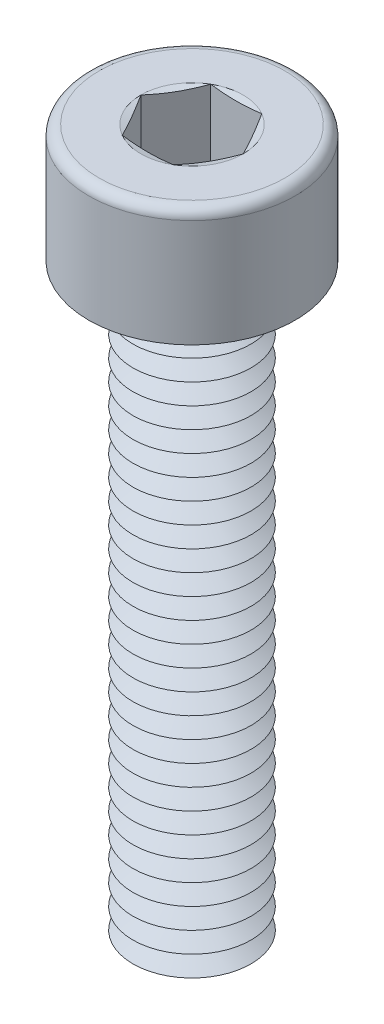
ISO-10303-21;
HEADER;
FILE_DESCRIPTION(('STEP AP214'),'2;1');
FILE_NAME('part.step','',(''),(''),'','','');
FILE_SCHEMA(('AUTOMOTIVE_DESIGN { 1 0 10303 214 1 1 1 1 }'));
ENDSEC;
DATA;
#1=APPLICATION_CONTEXT('core data for automotive mechanical design processes');
#2=APPLICATION_PROTOCOL_DEFINITION('international standard','automotive_design',2000,#1);
#3=PRODUCT_CONTEXT('',#1,'mechanical');
#4=PRODUCT('Part','Part','',(#3));
#5=PRODUCT_RELATED_PRODUCT_CATEGORY('part','',(#4));
#6=PRODUCT_DEFINITION_FORMATION('','',#4);
#7=PRODUCT_DEFINITION_CONTEXT('part definition',#1,'design');
#8=PRODUCT_DEFINITION('design','',#6,#7);
#9=PRODUCT_DEFINITION_SHAPE('','',#8);
#10=(LENGTH_UNIT() NAMED_UNIT(*) SI_UNIT(.MILLI.,.METRE.));
#11=(NAMED_UNIT(*) PLANE_ANGLE_UNIT() SI_UNIT($,.RADIAN.));
#12=(NAMED_UNIT(*) SI_UNIT($,.STERADIAN.) SOLID_ANGLE_UNIT());
#13=UNCERTAINTY_MEASURE_WITH_UNIT(LENGTH_MEASURE(1.E-05),#10,'distance_accuracy_value','');
#14=(GEOMETRIC_REPRESENTATION_CONTEXT(3) GLOBAL_UNCERTAINTY_ASSIGNED_CONTEXT((#13)) GLOBAL_UNIT_ASSIGNED_CONTEXT((#10,
#11,#12)) REPRESENTATION_CONTEXT('',''));
#15=CARTESIAN_POINT('',(0.,0.,0.));
#16=DIRECTION('',(0.,0.,1.));
#17=DIRECTION('',(1.,0.,0.));
#18=AXIS2_PLACEMENT_3D('',#15,#16,#17);
#19=CARTESIAN_POINT('',(0.,2.8,0.));
#20=DIRECTION('',(0.,1.,0.));
#21=DIRECTION('',(0.,0.,1.));
#22=AXIS2_PLACEMENT_3D('',#19,#20,#21);
#23=CONICAL_SURFACE('',#22,1.39378221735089,1.0471975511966);
#24=CARTESIAN_POINT('',(0.,3.15,0.));
#25=DIRECTION('',(0.,1.,0.));
#26=DIRECTION('',(0.,0.,1.));
#27=AXIS2_PLACEMENT_3D('',#24,#25,#26);
#28=CIRCLE('',#27,2.);
#29=CARTESIAN_POINT('',(0.,3.15,2.));
#30=VERTEX_POINT('',#29);
#31=EDGE_CURVE('E542',#30,#30,#28,.T.);
#32=ORIENTED_EDGE('',*,*,#31,.F.);
#33=EDGE_LOOP('',(#32));
#34=FACE_BOUND('',#33,.T.);
#35=CARTESIAN_POINT('',(0.,2.8,0.));
#36=DIRECTION('',(0.,1.,0.));
#37=DIRECTION('',(0.,0.,1.));
#38=AXIS2_PLACEMENT_3D('',#35,#36,#37);
#39=CIRCLE('',#38,1.39378221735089);
#40=CARTESIAN_POINT('',(0.,2.8,1.39378221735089));
#41=VERTEX_POINT('',#40);
#42=EDGE_CURVE('E546',#41,#41,#39,.T.);
#43=ORIENTED_EDGE('',*,*,#42,.T.);
#44=EDGE_LOOP('',(#43));
#45=FACE_BOUND('',#44,.T.);
#46=ADVANCED_FACE('F41',(#34,#45),#23,.T.);
#47=CARTESIAN_POINT('',(0.,2.45,0.));
#48=DIRECTION('',(0.,-1.,0.));
#49=DIRECTION('',(0.,0.,-1.));
#50=AXIS2_PLACEMENT_3D('',#47,#48,#49);
#51=CONICAL_SURFACE('',#50,2.,1.0471975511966);
#52=ORIENTED_EDGE('',*,*,#42,.F.);
#53=EDGE_LOOP('',(#52));
#54=FACE_BOUND('',#53,.T.);
#55=CARTESIAN_POINT('',(0.,2.45,0.));
#56=DIRECTION('',(0.,1.,0.));
#57=DIRECTION('',(0.,0.,1.));
#58=AXIS2_PLACEMENT_3D('',#55,#56,#57);
#59=CIRCLE('',#58,2.);
#60=CARTESIAN_POINT('',(0.,2.45,2.));
#61=VERTEX_POINT('',#60);
#62=EDGE_CURVE('E549',#61,#61,#59,.T.);
#63=ORIENTED_EDGE('',*,*,#62,.T.);
#64=EDGE_LOOP('',(#63));
#65=FACE_BOUND('',#64,.T.);
#66=ADVANCED_FACE('F251',(#54,#65),#51,.T.);
#67=CARTESIAN_POINT('',(0.,0.,0.));
#68=DIRECTION('',(0.,1.,0.));
#69=DIRECTION('',(0.,0.,1.));
#70=AXIS2_PLACEMENT_3D('',#67,#68,#69);
#71=PLANE('',#70);
#72=CARTESIAN_POINT('',(0.,0.,0.));
#73=DIRECTION('',(0.,1.,0.));
#74=DIRECTION('',(0.,0.,1.));
#75=AXIS2_PLACEMENT_3D('',#72,#73,#74);
#76=CIRCLE('',#75,1.39378221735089);
#77=CARTESIAN_POINT('',(0.,0.,1.39378221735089));
#78=VERTEX_POINT('',#77);
#79=EDGE_CURVE('E577',#78,#78,#76,.T.);
#80=ORIENTED_EDGE('',*,*,#79,.F.);
#81=EDGE_LOOP('',(#80));
#82=FACE_BOUND('',#81,.T.);
#83=ADVANCED_FACE('F248',(#82),#71,.F.);
#84=CARTESIAN_POINT('',(0.,0.,0.));
#85=DIRECTION('',(0.,1.,0.));
#86=DIRECTION('',(0.,0.,1.));
#87=AXIS2_PLACEMENT_3D('',#84,#85,#86);
#88=CONICAL_SURFACE('',#87,1.39378221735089,1.0471975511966);
#89=CARTESIAN_POINT('',(0.,0.35,0.));
#90=DIRECTION('',(0.,1.,0.));
#91=DIRECTION('',(0.,0.,1.));
#92=AXIS2_PLACEMENT_3D('',#89,#90,#91);
#93=CIRCLE('',#92,2.);
#94=CARTESIAN_POINT('',(0.,0.35,2.));
#95=VERTEX_POINT('',#94);
#96=EDGE_CURVE('E573',#95,#95,#93,.T.);
#97=ORIENTED_EDGE('',*,*,#96,.F.);
#98=EDGE_LOOP('',(#97));
#99=FACE_BOUND('',#98,.T.);
#100=ORIENTED_EDGE('',*,*,#79,.T.);
#101=EDGE_LOOP('',(#100));
#102=FACE_BOUND('',#101,.T.);
#103=ADVANCED_FACE('F250',(#99,#102),#88,.T.);
#104=CARTESIAN_POINT('',(0.,0.35,0.));
#105=DIRECTION('',(0.,-1.,0.));
#106=DIRECTION('',(0.,0.,-1.));
#107=AXIS2_PLACEMENT_3D('',#104,#105,#106);
#108=CONICAL_SURFACE('',#107,2.,1.0471975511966);
#109=CARTESIAN_POINT('',(0.,0.7,0.));
#110=DIRECTION('',(0.,1.,0.));
#111=DIRECTION('',(0.,0.,1.));
#112=AXIS2_PLACEMENT_3D('',#109,#110,#111);
#113=CIRCLE('',#112,1.39378221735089);
#114=CARTESIAN_POINT('',(0.,0.7,1.39378221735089));
#115=VERTEX_POINT('',#114);
#116=EDGE_CURVE('E569',#115,#115,#113,.T.);
#117=ORIENTED_EDGE('',*,*,#116,.F.);
#118=EDGE_LOOP('',(#117));
#119=FACE_BOUND('',#118,.T.);
#120=ORIENTED_EDGE('',*,*,#96,.T.);
#121=EDGE_LOOP('',(#120));
#122=FACE_BOUND('',#121,.T.);
#123=ADVANCED_FACE('F291',(#119,#122),#108,.T.);
#124=CARTESIAN_POINT('',(0.,0.7,0.));
#125=DIRECTION('',(0.,1.,0.));
#126=DIRECTION('',(0.,0.,1.));
#127=AXIS2_PLACEMENT_3D('',#124,#125,#126);
#128=CONICAL_SURFACE('',#127,1.39378221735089,1.0471975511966);
#129=CARTESIAN_POINT('',(0.,1.05,0.));
#130=DIRECTION('',(0.,1.,0.));
#131=DIRECTION('',(0.,0.,1.));
#132=AXIS2_PLACEMENT_3D('',#129,#130,#131);
#133=CIRCLE('',#132,2.);
#134=CARTESIAN_POINT('',(0.,1.05,2.));
#135=VERTEX_POINT('',#134);
#136=EDGE_CURVE('E565',#135,#135,#133,.T.);
#137=ORIENTED_EDGE('',*,*,#136,.F.);
#138=EDGE_LOOP('',(#137));
#139=FACE_BOUND('',#138,.T.);
#140=ORIENTED_EDGE('',*,*,#116,.T.);
#141=EDGE_LOOP('',(#140));
#142=FACE_BOUND('',#141,.T.);
#143=ADVANCED_FACE('F286',(#139,#142),#128,.T.);
#144=CARTESIAN_POINT('',(0.,1.05,0.));
#145=DIRECTION('',(0.,-1.,0.));
#146=DIRECTION('',(0.,0.,-1.));
#147=AXIS2_PLACEMENT_3D('',#144,#145,#146);
#148=CONICAL_SURFACE('',#147,2.,1.0471975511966);
#149=CARTESIAN_POINT('',(0.,1.4,0.));
#150=DIRECTION('',(0.,1.,0.));
#151=DIRECTION('',(0.,0.,1.));
#152=AXIS2_PLACEMENT_3D('',#149,#150,#151);
#153=CIRCLE('',#152,1.39378221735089);
#154=CARTESIAN_POINT('',(0.,1.4,1.39378221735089));
#155=VERTEX_POINT('',#154);
#156=EDGE_CURVE('E561',#155,#155,#153,.T.);
#157=ORIENTED_EDGE('',*,*,#156,.F.);
#158=EDGE_LOOP('',(#157));
#159=FACE_BOUND('',#158,.T.);
#160=ORIENTED_EDGE('',*,*,#136,.T.);
#161=EDGE_LOOP('',(#160));
#162=FACE_BOUND('',#161,.T.);
#163=ADVANCED_FACE('F283',(#159,#162),#148,.T.);
#164=CARTESIAN_POINT('',(0.,1.4,0.));
#165=DIRECTION('',(0.,1.,0.));
#166=DIRECTION('',(0.,0.,1.));
#167=AXIS2_PLACEMENT_3D('',#164,#165,#166);
#168=CONICAL_SURFACE('',#167,1.39378221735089,1.0471975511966);
#169=CARTESIAN_POINT('',(0.,1.75,0.));
#170=DIRECTION('',(0.,1.,0.));
#171=DIRECTION('',(0.,0.,1.));
#172=AXIS2_PLACEMENT_3D('',#169,#170,#171);
#173=CIRCLE('',#172,2.);
#174=CARTESIAN_POINT('',(0.,1.75,2.));
#175=VERTEX_POINT('',#174);
#176=EDGE_CURVE('E557',#175,#175,#173,.T.);
#177=ORIENTED_EDGE('',*,*,#176,.F.);
#178=EDGE_LOOP('',(#177));
#179=FACE_BOUND('',#178,.T.);
#180=ORIENTED_EDGE('',*,*,#156,.T.);
#181=EDGE_LOOP('',(#180));
#182=FACE_BOUND('',#181,.T.);
#183=ADVANCED_FACE('F277',(#179,#182),#168,.T.);
#184=CARTESIAN_POINT('',(0.,1.75,0.));
#185=DIRECTION('',(0.,-1.,0.));
#186=DIRECTION('',(0.,0.,-1.));
#187=AXIS2_PLACEMENT_3D('',#184,#185,#186);
#188=CONICAL_SURFACE('',#187,2.,1.0471975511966);
#189=CARTESIAN_POINT('',(0.,2.1,0.));
#190=DIRECTION('',(0.,1.,0.));
#191=DIRECTION('',(0.,0.,1.));
#192=AXIS2_PLACEMENT_3D('',#189,#190,#191);
#193=CIRCLE('',#192,1.39378221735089);
#194=CARTESIAN_POINT('',(0.,2.1,1.39378221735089));
#195=VERTEX_POINT('',#194);
#196=EDGE_CURVE('E553',#195,#195,#193,.T.);
#197=ORIENTED_EDGE('',*,*,#196,.F.);
#198=EDGE_LOOP('',(#197));
#199=FACE_BOUND('',#198,.T.);
#200=ORIENTED_EDGE('',*,*,#176,.T.);
#201=EDGE_LOOP('',(#200));
#202=FACE_BOUND('',#201,.T.);
#203=ADVANCED_FACE('F273',(#199,#202),#188,.T.);
#204=CARTESIAN_POINT('',(0.,2.1,0.));
#205=DIRECTION('',(0.,1.,0.));
#206=DIRECTION('',(0.,0.,1.));
#207=AXIS2_PLACEMENT_3D('',#204,#205,#206);
#208=CONICAL_SURFACE('',#207,1.39378221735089,1.0471975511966);
#209=ORIENTED_EDGE('',*,*,#62,.F.);
#210=EDGE_LOOP('',(#209));
#211=FACE_BOUND('',#210,.T.);
#212=ORIENTED_EDGE('',*,*,#196,.T.);
#213=EDGE_LOOP('',(#212));
#214=FACE_BOUND('',#213,.T.);
#215=ADVANCED_FACE('F276',(#211,#214),#208,.T.);
#216=CARTESIAN_POINT('',(0.,3.5,0.));
#217=DIRECTION('',(0.,1.,0.));
#218=DIRECTION('',(0.,0.,1.));
#219=AXIS2_PLACEMENT_3D('',#216,#217,#218);
#220=CONICAL_SURFACE('',#219,1.39378221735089,1.0471975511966);
#221=CARTESIAN_POINT('',(0.,3.85,0.));
#222=DIRECTION('',(0.,1.,0.));
#223=DIRECTION('',(0.,0.,1.));
#224=AXIS2_PLACEMENT_3D('',#221,#222,#223);
#225=CIRCLE('',#224,2.);
#226=CARTESIAN_POINT('',(0.,3.85,2.));
#227=VERTEX_POINT('',#226);
#228=EDGE_CURVE('E534',#227,#227,#225,.T.);
#229=ORIENTED_EDGE('',*,*,#228,.F.);
#230=EDGE_LOOP('',(#229));
#231=FACE_BOUND('',#230,.T.);
#232=CARTESIAN_POINT('',(0.,3.5,0.));
#233=DIRECTION('',(0.,1.,0.));
#234=DIRECTION('',(0.,0.,1.));
#235=AXIS2_PLACEMENT_3D('',#232,#233,#234);
#236=CIRCLE('',#235,1.39378221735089);
#237=CARTESIAN_POINT('',(0.,3.5,1.39378221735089));
#238=VERTEX_POINT('',#237);
#239=EDGE_CURVE('E538',#238,#238,#236,.T.);
#240=ORIENTED_EDGE('',*,*,#239,.T.);
#241=EDGE_LOOP('',(#240));
#242=FACE_BOUND('',#241,.T.);
#243=ADVANCED_FACE('F281',(#231,#242),#220,.T.);
#244=CARTESIAN_POINT('',(0.,3.15,0.));
#245=DIRECTION('',(0.,-1.,0.));
#246=DIRECTION('',(0.,0.,-1.));
#247=AXIS2_PLACEMENT_3D('',#244,#245,#246);
#248=CONICAL_SURFACE('',#247,2.,1.0471975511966);
#249=ORIENTED_EDGE('',*,*,#239,.F.);
#250=EDGE_LOOP('',(#249));
#251=FACE_BOUND('',#250,.T.);
#252=ORIENTED_EDGE('',*,*,#31,.T.);
#253=EDGE_LOOP('',(#252));
#254=FACE_BOUND('',#253,.T.);
#255=ADVANCED_FACE('F817',(#251,#254),#248,.T.);
#256=CARTESIAN_POINT('',(0.,4.2,0.));
#257=DIRECTION('',(0.,1.,0.));
#258=DIRECTION('',(0.,0.,1.));
#259=AXIS2_PLACEMENT_3D('',#256,#257,#258);
#260=CONICAL_SURFACE('',#259,1.39378221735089,1.0471975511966);
#261=CARTESIAN_POINT('',(0.,4.55,0.));
#262=DIRECTION('',(0.,1.,0.));
#263=DIRECTION('',(0.,0.,1.));
#264=AXIS2_PLACEMENT_3D('',#261,#262,#263);
#265=CIRCLE('',#264,2.);
#266=CARTESIAN_POINT('',(0.,4.55,2.));
#267=VERTEX_POINT('',#266);
#268=EDGE_CURVE('E526',#267,#267,#265,.T.);
#269=ORIENTED_EDGE('',*,*,#268,.F.);
#270=EDGE_LOOP('',(#269));
#271=FACE_BOUND('',#270,.T.);
#272=CARTESIAN_POINT('',(0.,4.2,0.));
#273=DIRECTION('',(0.,1.,0.));
#274=DIRECTION('',(0.,0.,1.));
#275=AXIS2_PLACEMENT_3D('',#272,#273,#274);
#276=CIRCLE('',#275,1.39378221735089);
#277=CARTESIAN_POINT('',(0.,4.2,1.39378221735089));
#278=VERTEX_POINT('',#277);
#279=EDGE_CURVE('E530',#278,#278,#276,.T.);
#280=ORIENTED_EDGE('',*,*,#279,.T.);
#281=EDGE_LOOP('',(#280));
#282=FACE_BOUND('',#281,.T.);
#283=ADVANCED_FACE('F826',(#271,#282),#260,.T.);
#284=CARTESIAN_POINT('',(0.,3.85,0.));
#285=DIRECTION('',(0.,-1.,0.));
#286=DIRECTION('',(0.,0.,-1.));
#287=AXIS2_PLACEMENT_3D('',#284,#285,#286);
#288=CONICAL_SURFACE('',#287,2.,1.0471975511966);
#289=ORIENTED_EDGE('',*,*,#279,.F.);
#290=EDGE_LOOP('',(#289));
#291=FACE_BOUND('',#290,.T.);
#292=ORIENTED_EDGE('',*,*,#228,.T.);
#293=EDGE_LOOP('',(#292));
#294=FACE_BOUND('',#293,.T.);
#295=ADVANCED_FACE('F836',(#291,#294),#288,.T.);
#296=CARTESIAN_POINT('',(0.,4.9,0.));
#297=DIRECTION('',(0.,1.,0.));
#298=DIRECTION('',(0.,0.,1.));
#299=AXIS2_PLACEMENT_3D('',#296,#297,#298);
#300=CONICAL_SURFACE('',#299,1.39378221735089,1.0471975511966);
#301=CARTESIAN_POINT('',(0.,5.25,0.));
#302=DIRECTION('',(0.,1.,0.));
#303=DIRECTION('',(0.,0.,1.));
#304=AXIS2_PLACEMENT_3D('',#301,#302,#303);
#305=CIRCLE('',#304,2.);
#306=CARTESIAN_POINT('',(0.,5.25,2.));
#307=VERTEX_POINT('',#306);
#308=EDGE_CURVE('E518',#307,#307,#305,.T.);
#309=ORIENTED_EDGE('',*,*,#308,.F.);
#310=EDGE_LOOP('',(#309));
#311=FACE_BOUND('',#310,.T.);
#312=CARTESIAN_POINT('',(0.,4.9,0.));
#313=DIRECTION('',(0.,1.,0.));
#314=DIRECTION('',(0.,0.,1.));
#315=AXIS2_PLACEMENT_3D('',#312,#313,#314);
#316=CIRCLE('',#315,1.39378221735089);
#317=CARTESIAN_POINT('',(0.,4.9,1.39378221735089));
#318=VERTEX_POINT('',#317);
#319=EDGE_CURVE('E522',#318,#318,#316,.T.);
#320=ORIENTED_EDGE('',*,*,#319,.T.);
#321=EDGE_LOOP('',(#320));
#322=FACE_BOUND('',#321,.T.);
#323=ADVANCED_FACE('F846',(#311,#322),#300,.T.);
#324=CARTESIAN_POINT('',(0.,4.55,0.));
#325=DIRECTION('',(0.,-1.,0.));
#326=DIRECTION('',(0.,0.,-1.));
#327=AXIS2_PLACEMENT_3D('',#324,#325,#326);
#328=CONICAL_SURFACE('',#327,2.,1.0471975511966);
#329=ORIENTED_EDGE('',*,*,#319,.F.);
#330=EDGE_LOOP('',(#329));
#331=FACE_BOUND('',#330,.T.);
#332=ORIENTED_EDGE('',*,*,#268,.T.);
#333=EDGE_LOOP('',(#332));
#334=FACE_BOUND('',#333,.T.);
#335=ADVANCED_FACE('F856',(#331,#334),#328,.T.);
#336=CARTESIAN_POINT('',(0.,5.6,0.));
#337=DIRECTION('',(0.,1.,0.));
#338=DIRECTION('',(0.,0.,1.));
#339=AXIS2_PLACEMENT_3D('',#336,#337,#338);
#340=CONICAL_SURFACE('',#339,1.39378221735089,1.0471975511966);
#341=CARTESIAN_POINT('',(0.,5.95,0.));
#342=DIRECTION('',(0.,1.,0.));
#343=DIRECTION('',(0.,0.,1.));
#344=AXIS2_PLACEMENT_3D('',#341,#342,#343);
#345=CIRCLE('',#344,2.);
#346=CARTESIAN_POINT('',(0.,5.95,2.));
#347=VERTEX_POINT('',#346);
#348=EDGE_CURVE('E510',#347,#347,#345,.T.);
#349=ORIENTED_EDGE('',*,*,#348,.F.);
#350=EDGE_LOOP('',(#349));
#351=FACE_BOUND('',#350,.T.);
#352=CARTESIAN_POINT('',(0.,5.6,0.));
#353=DIRECTION('',(0.,1.,0.));
#354=DIRECTION('',(0.,0.,1.));
#355=AXIS2_PLACEMENT_3D('',#352,#353,#354);
#356=CIRCLE('',#355,1.39378221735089);
#357=CARTESIAN_POINT('',(0.,5.6,1.39378221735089));
#358=VERTEX_POINT('',#357);
#359=EDGE_CURVE('E514',#358,#358,#356,.T.);
#360=ORIENTED_EDGE('',*,*,#359,.T.);
#361=EDGE_LOOP('',(#360));
#362=FACE_BOUND('',#361,.T.);
#363=ADVANCED_FACE('F866',(#351,#362),#340,.T.);
#364=CARTESIAN_POINT('',(0.,5.25,0.));
#365=DIRECTION('',(0.,-1.,0.));
#366=DIRECTION('',(0.,0.,-1.));
#367=AXIS2_PLACEMENT_3D('',#364,#365,#366);
#368=CONICAL_SURFACE('',#367,2.,1.0471975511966);
#369=ORIENTED_EDGE('',*,*,#359,.F.);
#370=EDGE_LOOP('',(#369));
#371=FACE_BOUND('',#370,.T.);
#372=ORIENTED_EDGE('',*,*,#308,.T.);
#373=EDGE_LOOP('',(#372));
#374=FACE_BOUND('',#373,.T.);
#375=ADVANCED_FACE('F876',(#371,#374),#368,.T.);
#376=CARTESIAN_POINT('',(0.,6.3,0.));
#377=DIRECTION('',(0.,1.,0.));
#378=DIRECTION('',(0.,0.,1.));
#379=AXIS2_PLACEMENT_3D('',#376,#377,#378);
#380=CONICAL_SURFACE('',#379,1.39378221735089,1.0471975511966);
#381=CARTESIAN_POINT('',(0.,6.65,0.));
#382=DIRECTION('',(0.,1.,0.));
#383=DIRECTION('',(0.,0.,1.));
#384=AXIS2_PLACEMENT_3D('',#381,#382,#383);
#385=CIRCLE('',#384,2.);
#386=CARTESIAN_POINT('',(0.,6.65,2.));
#387=VERTEX_POINT('',#386);
#388=EDGE_CURVE('E502',#387,#387,#385,.T.);
#389=ORIENTED_EDGE('',*,*,#388,.F.);
#390=EDGE_LOOP('',(#389));
#391=FACE_BOUND('',#390,.T.);
#392=CARTESIAN_POINT('',(0.,6.3,0.));
#393=DIRECTION('',(0.,1.,0.));
#394=DIRECTION('',(0.,0.,1.));
#395=AXIS2_PLACEMENT_3D('',#392,#393,#394);
#396=CIRCLE('',#395,1.39378221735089);
#397=CARTESIAN_POINT('',(0.,6.3,1.39378221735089));
#398=VERTEX_POINT('',#397);
#399=EDGE_CURVE('E506',#398,#398,#396,.T.);
#400=ORIENTED_EDGE('',*,*,#399,.T.);
#401=EDGE_LOOP('',(#400));
#402=FACE_BOUND('',#401,.T.);
#403=ADVANCED_FACE('F886',(#391,#402),#380,.T.);
#404=CARTESIAN_POINT('',(0.,5.95,0.));
#405=DIRECTION('',(0.,-1.,0.));
#406=DIRECTION('',(0.,0.,-1.));
#407=AXIS2_PLACEMENT_3D('',#404,#405,#406);
#408=CONICAL_SURFACE('',#407,2.,1.0471975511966);
#409=ORIENTED_EDGE('',*,*,#399,.F.);
#410=EDGE_LOOP('',(#409));
#411=FACE_BOUND('',#410,.T.);
#412=ORIENTED_EDGE('',*,*,#348,.T.);
#413=EDGE_LOOP('',(#412));
#414=FACE_BOUND('',#413,.T.);
#415=ADVANCED_FACE('F896',(#411,#414),#408,.T.);
#416=CARTESIAN_POINT('',(0.,7.,0.));
#417=DIRECTION('',(0.,1.,0.));
#418=DIRECTION('',(0.,0.,1.));
#419=AXIS2_PLACEMENT_3D('',#416,#417,#418);
#420=CONICAL_SURFACE('',#419,1.39378221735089,1.0471975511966);
#421=CARTESIAN_POINT('',(0.,7.35,0.));
#422=DIRECTION('',(0.,1.,0.));
#423=DIRECTION('',(0.,0.,1.));
#424=AXIS2_PLACEMENT_3D('',#421,#422,#423);
#425=CIRCLE('',#424,2.);
#426=CARTESIAN_POINT('',(0.,7.35,2.));
#427=VERTEX_POINT('',#426);
#428=EDGE_CURVE('E494',#427,#427,#425,.T.);
#429=ORIENTED_EDGE('',*,*,#428,.F.);
#430=EDGE_LOOP('',(#429));
#431=FACE_BOUND('',#430,.T.);
#432=CARTESIAN_POINT('',(0.,7.,0.));
#433=DIRECTION('',(0.,1.,0.));
#434=DIRECTION('',(0.,0.,1.));
#435=AXIS2_PLACEMENT_3D('',#432,#433,#434);
#436=CIRCLE('',#435,1.39378221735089);
#437=CARTESIAN_POINT('',(0.,7.,1.39378221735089));
#438=VERTEX_POINT('',#437);
#439=EDGE_CURVE('E498',#438,#438,#436,.T.);
#440=ORIENTED_EDGE('',*,*,#439,.T.);
#441=EDGE_LOOP('',(#440));
#442=FACE_BOUND('',#441,.T.);
#443=ADVANCED_FACE('F906',(#431,#442),#420,.T.);
#444=CARTESIAN_POINT('',(0.,6.65,0.));
#445=DIRECTION('',(0.,-1.,0.));
#446=DIRECTION('',(0.,0.,-1.));
#447=AXIS2_PLACEMENT_3D('',#444,#445,#446);
#448=CONICAL_SURFACE('',#447,2.,1.0471975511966);
#449=ORIENTED_EDGE('',*,*,#439,.F.);
#450=EDGE_LOOP('',(#449));
#451=FACE_BOUND('',#450,.T.);
#452=ORIENTED_EDGE('',*,*,#388,.T.);
#453=EDGE_LOOP('',(#452));
#454=FACE_BOUND('',#453,.T.);
#455=ADVANCED_FACE('F916',(#451,#454),#448,.T.);
#456=CARTESIAN_POINT('',(0.,7.7,0.));
#457=DIRECTION('',(0.,1.,0.));
#458=DIRECTION('',(0.,0.,1.));
#459=AXIS2_PLACEMENT_3D('',#456,#457,#458);
#460=CONICAL_SURFACE('',#459,1.39378221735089,1.0471975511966);
#461=CARTESIAN_POINT('',(0.,8.05,0.));
#462=DIRECTION('',(0.,1.,0.));
#463=DIRECTION('',(0.,0.,1.));
#464=AXIS2_PLACEMENT_3D('',#461,#462,#463);
#465=CIRCLE('',#464,2.);
#466=CARTESIAN_POINT('',(0.,8.05,2.));
#467=VERTEX_POINT('',#466);
#468=EDGE_CURVE('E486',#467,#467,#465,.T.);
#469=ORIENTED_EDGE('',*,*,#468,.F.);
#470=EDGE_LOOP('',(#469));
#471=FACE_BOUND('',#470,.T.);
#472=CARTESIAN_POINT('',(0.,7.7,0.));
#473=DIRECTION('',(0.,1.,0.));
#474=DIRECTION('',(0.,0.,1.));
#475=AXIS2_PLACEMENT_3D('',#472,#473,#474);
#476=CIRCLE('',#475,1.39378221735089);
#477=CARTESIAN_POINT('',(0.,7.7,1.39378221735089));
#478=VERTEX_POINT('',#477);
#479=EDGE_CURVE('E490',#478,#478,#476,.T.);
#480=ORIENTED_EDGE('',*,*,#479,.T.);
#481=EDGE_LOOP('',(#480));
#482=FACE_BOUND('',#481,.T.);
#483=ADVANCED_FACE('F926',(#471,#482),#460,.T.);
#484=CARTESIAN_POINT('',(0.,7.35,0.));
#485=DIRECTION('',(0.,-1.,0.));
#486=DIRECTION('',(0.,0.,-1.));
#487=AXIS2_PLACEMENT_3D('',#484,#485,#486);
#488=CONICAL_SURFACE('',#487,2.,1.0471975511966);
#489=ORIENTED_EDGE('',*,*,#479,.F.);
#490=EDGE_LOOP('',(#489));
#491=FACE_BOUND('',#490,.T.);
#492=ORIENTED_EDGE('',*,*,#428,.T.);
#493=EDGE_LOOP('',(#492));
#494=FACE_BOUND('',#493,.T.);
#495=ADVANCED_FACE('F936',(#491,#494),#488,.T.);
#496=CARTESIAN_POINT('',(0.,8.4,0.));
#497=DIRECTION('',(0.,1.,0.));
#498=DIRECTION('',(0.,0.,1.));
#499=AXIS2_PLACEMENT_3D('',#496,#497,#498);
#500=CONICAL_SURFACE('',#499,1.39378221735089,1.0471975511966);
#501=CARTESIAN_POINT('',(0.,8.75,0.));
#502=DIRECTION('',(0.,1.,0.));
#503=DIRECTION('',(0.,0.,1.));
#504=AXIS2_PLACEMENT_3D('',#501,#502,#503);
#505=CIRCLE('',#504,2.);
#506=CARTESIAN_POINT('',(0.,8.75,2.));
#507=VERTEX_POINT('',#506);
#508=EDGE_CURVE('E478',#507,#507,#505,.T.);
#509=ORIENTED_EDGE('',*,*,#508,.F.);
#510=EDGE_LOOP('',(#509));
#511=FACE_BOUND('',#510,.T.);
#512=CARTESIAN_POINT('',(0.,8.4,0.));
#513=DIRECTION('',(0.,1.,0.));
#514=DIRECTION('',(0.,0.,1.));
#515=AXIS2_PLACEMENT_3D('',#512,#513,#514);
#516=CIRCLE('',#515,1.39378221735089);
#517=CARTESIAN_POINT('',(0.,8.4,1.39378221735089));
#518=VERTEX_POINT('',#517);
#519=EDGE_CURVE('E482',#518,#518,#516,.T.);
#520=ORIENTED_EDGE('',*,*,#519,.T.);
#521=EDGE_LOOP('',(#520));
#522=FACE_BOUND('',#521,.T.);
#523=ADVANCED_FACE('F946',(#511,#522),#500,.T.);
#524=CARTESIAN_POINT('',(0.,8.05,0.));
#525=DIRECTION('',(0.,-1.,0.));
#526=DIRECTION('',(0.,0.,-1.));
#527=AXIS2_PLACEMENT_3D('',#524,#525,#526);
#528=CONICAL_SURFACE('',#527,2.,1.0471975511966);
#529=ORIENTED_EDGE('',*,*,#519,.F.);
#530=EDGE_LOOP('',(#529));
#531=FACE_BOUND('',#530,.T.);
#532=ORIENTED_EDGE('',*,*,#468,.T.);
#533=EDGE_LOOP('',(#532));
#534=FACE_BOUND('',#533,.T.);
#535=ADVANCED_FACE('F956',(#531,#534),#528,.T.);
#536=CARTESIAN_POINT('',(0.,9.1,0.));
#537=DIRECTION('',(0.,1.,0.));
#538=DIRECTION('',(0.,0.,1.));
#539=AXIS2_PLACEMENT_3D('',#536,#537,#538);
#540=CONICAL_SURFACE('',#539,1.39378221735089,1.0471975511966);
#541=CARTESIAN_POINT('',(0.,9.45,0.));
#542=DIRECTION('',(0.,1.,0.));
#543=DIRECTION('',(0.,0.,1.));
#544=AXIS2_PLACEMENT_3D('',#541,#542,#543);
#545=CIRCLE('',#544,2.);
#546=CARTESIAN_POINT('',(0.,9.45,2.));
#547=VERTEX_POINT('',#546);
#548=EDGE_CURVE('E470',#547,#547,#545,.T.);
#549=ORIENTED_EDGE('',*,*,#548,.F.);
#550=EDGE_LOOP('',(#549));
#551=FACE_BOUND('',#550,.T.);
#552=CARTESIAN_POINT('',(0.,9.1,0.));
#553=DIRECTION('',(0.,1.,0.));
#554=DIRECTION('',(0.,0.,1.));
#555=AXIS2_PLACEMENT_3D('',#552,#553,#554);
#556=CIRCLE('',#555,1.39378221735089);
#557=CARTESIAN_POINT('',(0.,9.1,1.39378221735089));
#558=VERTEX_POINT('',#557);
#559=EDGE_CURVE('E474',#558,#558,#556,.T.);
#560=ORIENTED_EDGE('',*,*,#559,.T.);
#561=EDGE_LOOP('',(#560));
#562=FACE_BOUND('',#561,.T.);
#563=ADVANCED_FACE('F966',(#551,#562),#540,.T.);
#564=CARTESIAN_POINT('',(0.,8.75,0.));
#565=DIRECTION('',(0.,-1.,0.));
#566=DIRECTION('',(0.,0.,-1.));
#567=AXIS2_PLACEMENT_3D('',#564,#565,#566);
#568=CONICAL_SURFACE('',#567,2.,1.0471975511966);
#569=ORIENTED_EDGE('',*,*,#559,.F.);
#570=EDGE_LOOP('',(#569));
#571=FACE_BOUND('',#570,.T.);
#572=ORIENTED_EDGE('',*,*,#508,.T.);
#573=EDGE_LOOP('',(#572));
#574=FACE_BOUND('',#573,.T.);
#575=ADVANCED_FACE('F976',(#571,#574),#568,.T.);
#576=CARTESIAN_POINT('',(0.,9.8,0.));
#577=DIRECTION('',(0.,1.,0.));
#578=DIRECTION('',(0.,0.,1.));
#579=AXIS2_PLACEMENT_3D('',#576,#577,#578);
#580=CONICAL_SURFACE('',#579,1.39378221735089,1.0471975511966);
#581=CARTESIAN_POINT('',(0.,10.15,0.));
#582=DIRECTION('',(0.,1.,0.));
#583=DIRECTION('',(0.,0.,1.));
#584=AXIS2_PLACEMENT_3D('',#581,#582,#583);
#585=CIRCLE('',#584,2.);
#586=CARTESIAN_POINT('',(0.,10.15,2.));
#587=VERTEX_POINT('',#586);
#588=EDGE_CURVE('E462',#587,#587,#585,.T.);
#589=ORIENTED_EDGE('',*,*,#588,.F.);
#590=EDGE_LOOP('',(#589));
#591=FACE_BOUND('',#590,.T.);
#592=CARTESIAN_POINT('',(0.,9.8,0.));
#593=DIRECTION('',(0.,1.,0.));
#594=DIRECTION('',(0.,0.,1.));
#595=AXIS2_PLACEMENT_3D('',#592,#593,#594);
#596=CIRCLE('',#595,1.39378221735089);
#597=CARTESIAN_POINT('',(0.,9.8,1.39378221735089));
#598=VERTEX_POINT('',#597);
#599=EDGE_CURVE('E466',#598,#598,#596,.T.);
#600=ORIENTED_EDGE('',*,*,#599,.T.);
#601=EDGE_LOOP('',(#600));
#602=FACE_BOUND('',#601,.T.);
#603=ADVANCED_FACE('F986',(#591,#602),#580,.T.);
#604=CARTESIAN_POINT('',(0.,9.45,0.));
#605=DIRECTION('',(0.,-1.,0.));
#606=DIRECTION('',(0.,0.,-1.));
#607=AXIS2_PLACEMENT_3D('',#604,#605,#606);
#608=CONICAL_SURFACE('',#607,2.,1.0471975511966);
#609=ORIENTED_EDGE('',*,*,#599,.F.);
#610=EDGE_LOOP('',(#609));
#611=FACE_BOUND('',#610,.T.);
#612=ORIENTED_EDGE('',*,*,#548,.T.);
#613=EDGE_LOOP('',(#612));
#614=FACE_BOUND('',#613,.T.);
#615=ADVANCED_FACE('F996',(#611,#614),#608,.T.);
#616=CARTESIAN_POINT('',(0.,10.5,0.));
#617=DIRECTION('',(0.,1.,0.));
#618=DIRECTION('',(0.,0.,1.));
#619=AXIS2_PLACEMENT_3D('',#616,#617,#618);
#620=CONICAL_SURFACE('',#619,1.39378221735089,1.0471975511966);
#621=CARTESIAN_POINT('',(0.,10.85,0.));
#622=DIRECTION('',(0.,1.,0.));
#623=DIRECTION('',(0.,0.,1.));
#624=AXIS2_PLACEMENT_3D('',#621,#622,#623);
#625=CIRCLE('',#624,2.);
#626=CARTESIAN_POINT('',(0.,10.85,2.));
#627=VERTEX_POINT('',#626);
#628=EDGE_CURVE('E455',#627,#627,#625,.T.);
#629=ORIENTED_EDGE('',*,*,#628,.F.);
#630=EDGE_LOOP('',(#629));
#631=FACE_BOUND('',#630,.T.);
#632=CARTESIAN_POINT('',(0.,10.5,0.));
#633=DIRECTION('',(0.,1.,0.));
#634=DIRECTION('',(0.,0.,1.));
#635=AXIS2_PLACEMENT_3D('',#632,#633,#634);
#636=CIRCLE('',#635,1.39378221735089);
#637=CARTESIAN_POINT('',(0.,10.5,1.39378221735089));
#638=VERTEX_POINT('',#637);
#639=EDGE_CURVE('E458',#638,#638,#636,.T.);
#640=ORIENTED_EDGE('',*,*,#639,.T.);
#641=EDGE_LOOP('',(#640));
#642=FACE_BOUND('',#641,.T.);
#643=ADVANCED_FACE('F1006',(#631,#642),#620,.T.);
#644=CARTESIAN_POINT('',(0.,10.15,0.));
#645=DIRECTION('',(0.,-1.,0.));
#646=DIRECTION('',(0.,0.,-1.));
#647=AXIS2_PLACEMENT_3D('',#644,#645,#646);
#648=CONICAL_SURFACE('',#647,2.,1.0471975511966);
#649=ORIENTED_EDGE('',*,*,#639,.F.);
#650=EDGE_LOOP('',(#649));
#651=FACE_BOUND('',#650,.T.);
#652=ORIENTED_EDGE('',*,*,#588,.T.);
#653=EDGE_LOOP('',(#652));
#654=FACE_BOUND('',#653,.T.);
#655=ADVANCED_FACE('F1016',(#651,#654),#648,.T.);
#656=CARTESIAN_POINT('',(0.,11.2,0.));
#657=DIRECTION('',(0.,1.,0.));
#658=DIRECTION('',(0.,0.,1.));
#659=AXIS2_PLACEMENT_3D('',#656,#657,#658);
#660=CONICAL_SURFACE('',#659,1.39378221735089,1.0471975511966);
#661=CARTESIAN_POINT('',(0.,11.55,0.));
#662=DIRECTION('',(0.,1.,0.));
#663=DIRECTION('',(0.,0.,1.));
#664=AXIS2_PLACEMENT_3D('',#661,#662,#663);
#665=CIRCLE('',#664,2.);
#666=CARTESIAN_POINT('',(0.,11.55,2.));
#667=VERTEX_POINT('',#666);
#668=EDGE_CURVE('E447',#667,#667,#665,.T.);
#669=ORIENTED_EDGE('',*,*,#668,.F.);
#670=EDGE_LOOP('',(#669));
#671=FACE_BOUND('',#670,.T.);
#672=CARTESIAN_POINT('',(0.,11.2,0.));
#673=DIRECTION('',(0.,1.,0.));
#674=DIRECTION('',(0.,0.,1.));
#675=AXIS2_PLACEMENT_3D('',#672,#673,#674);
#676=CIRCLE('',#675,1.39378221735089);
#677=CARTESIAN_POINT('',(0.,11.2,1.39378221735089));
#678=VERTEX_POINT('',#677);
#679=EDGE_CURVE('E451',#678,#678,#676,.T.);
#680=ORIENTED_EDGE('',*,*,#679,.T.);
#681=EDGE_LOOP('',(#680));
#682=FACE_BOUND('',#681,.T.);
#683=ADVANCED_FACE('F1026',(#671,#682),#660,.T.);
#684=CARTESIAN_POINT('',(0.,10.85,0.));
#685=DIRECTION('',(0.,-1.,0.));
#686=DIRECTION('',(0.,0.,-1.));
#687=AXIS2_PLACEMENT_3D('',#684,#685,#686);
#688=CONICAL_SURFACE('',#687,2.,1.0471975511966);
#689=ORIENTED_EDGE('',*,*,#679,.F.);
#690=EDGE_LOOP('',(#689));
#691=FACE_BOUND('',#690,.T.);
#692=ORIENTED_EDGE('',*,*,#628,.T.);
#693=EDGE_LOOP('',(#692));
#694=FACE_BOUND('',#693,.T.);
#695=ADVANCED_FACE('F1036',(#691,#694),#688,.T.);
#696=CARTESIAN_POINT('',(0.,11.9,0.));
#697=DIRECTION('',(0.,1.,0.));
#698=DIRECTION('',(0.,0.,1.));
#699=AXIS2_PLACEMENT_3D('',#696,#697,#698);
#700=CONICAL_SURFACE('',#699,1.39378221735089,1.0471975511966);
#701=CARTESIAN_POINT('',(0.,12.25,0.));
#702=DIRECTION('',(0.,1.,0.));
#703=DIRECTION('',(0.,0.,1.));
#704=AXIS2_PLACEMENT_3D('',#701,#702,#703);
#705=CIRCLE('',#704,2.);
#706=CARTESIAN_POINT('',(0.,12.25,2.));
#707=VERTEX_POINT('',#706);
#708=EDGE_CURVE('E439',#707,#707,#705,.T.);
#709=ORIENTED_EDGE('',*,*,#708,.F.);
#710=EDGE_LOOP('',(#709));
#711=FACE_BOUND('',#710,.T.);
#712=CARTESIAN_POINT('',(0.,11.9,0.));
#713=DIRECTION('',(0.,1.,0.));
#714=DIRECTION('',(0.,0.,1.));
#715=AXIS2_PLACEMENT_3D('',#712,#713,#714);
#716=CIRCLE('',#715,1.39378221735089);
#717=CARTESIAN_POINT('',(0.,11.9,1.39378221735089));
#718=VERTEX_POINT('',#717);
#719=EDGE_CURVE('E443',#718,#718,#716,.T.);
#720=ORIENTED_EDGE('',*,*,#719,.T.);
#721=EDGE_LOOP('',(#720));
#722=FACE_BOUND('',#721,.T.);
#723=ADVANCED_FACE('F1046',(#711,#722),#700,.T.);
#724=CARTESIAN_POINT('',(0.,11.55,0.));
#725=DIRECTION('',(0.,-1.,0.));
#726=DIRECTION('',(0.,0.,-1.));
#727=AXIS2_PLACEMENT_3D('',#724,#725,#726);
#728=CONICAL_SURFACE('',#727,2.,1.0471975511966);
#729=ORIENTED_EDGE('',*,*,#719,.F.);
#730=EDGE_LOOP('',(#729));
#731=FACE_BOUND('',#730,.T.);
#732=ORIENTED_EDGE('',*,*,#668,.T.);
#733=EDGE_LOOP('',(#732));
#734=FACE_BOUND('',#733,.T.);
#735=ADVANCED_FACE('F1056',(#731,#734),#728,.T.);
#736=CARTESIAN_POINT('',(0.,12.6,0.));
#737=DIRECTION('',(0.,1.,0.));
#738=DIRECTION('',(0.,0.,1.));
#739=AXIS2_PLACEMENT_3D('',#736,#737,#738);
#740=CONICAL_SURFACE('',#739,1.39378221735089,1.0471975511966);
#741=CARTESIAN_POINT('',(0.,12.95,0.));
#742=DIRECTION('',(0.,1.,0.));
#743=DIRECTION('',(0.,0.,1.));
#744=AXIS2_PLACEMENT_3D('',#741,#742,#743);
#745=CIRCLE('',#744,2.);
#746=CARTESIAN_POINT('',(0.,12.95,2.));
#747=VERTEX_POINT('',#746);
#748=EDGE_CURVE('E431',#747,#747,#745,.T.);
#749=ORIENTED_EDGE('',*,*,#748,.F.);
#750=EDGE_LOOP('',(#749));
#751=FACE_BOUND('',#750,.T.);
#752=CARTESIAN_POINT('',(0.,12.6,0.));
#753=DIRECTION('',(0.,1.,0.));
#754=DIRECTION('',(0.,0.,1.));
#755=AXIS2_PLACEMENT_3D('',#752,#753,#754);
#756=CIRCLE('',#755,1.39378221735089);
#757=CARTESIAN_POINT('',(0.,12.6,1.39378221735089));
#758=VERTEX_POINT('',#757);
#759=EDGE_CURVE('E435',#758,#758,#756,.T.);
#760=ORIENTED_EDGE('',*,*,#759,.T.);
#761=EDGE_LOOP('',(#760));
#762=FACE_BOUND('',#761,.T.);
#763=ADVANCED_FACE('F1066',(#751,#762),#740,.T.);
#764=CARTESIAN_POINT('',(0.,12.25,0.));
#765=DIRECTION('',(0.,-1.,0.));
#766=DIRECTION('',(0.,0.,-1.));
#767=AXIS2_PLACEMENT_3D('',#764,#765,#766);
#768=CONICAL_SURFACE('',#767,2.,1.0471975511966);
#769=ORIENTED_EDGE('',*,*,#759,.F.);
#770=EDGE_LOOP('',(#769));
#771=FACE_BOUND('',#770,.T.);
#772=ORIENTED_EDGE('',*,*,#708,.T.);
#773=EDGE_LOOP('',(#772));
#774=FACE_BOUND('',#773,.T.);
#775=ADVANCED_FACE('F1076',(#771,#774),#768,.T.);
#776=CARTESIAN_POINT('',(0.,13.3,0.));
#777=DIRECTION('',(0.,1.,0.));
#778=DIRECTION('',(0.,0.,1.));
#779=AXIS2_PLACEMENT_3D('',#776,#777,#778);
#780=CONICAL_SURFACE('',#779,1.39378221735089,1.0471975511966);
#781=CARTESIAN_POINT('',(0.,13.65,0.));
#782=DIRECTION('',(0.,1.,0.));
#783=DIRECTION('',(0.,0.,1.));
#784=AXIS2_PLACEMENT_3D('',#781,#782,#783);
#785=CIRCLE('',#784,2.);
#786=CARTESIAN_POINT('',(0.,13.65,2.));
#787=VERTEX_POINT('',#786);
#788=EDGE_CURVE('E423',#787,#787,#785,.T.);
#789=ORIENTED_EDGE('',*,*,#788,.F.);
#790=EDGE_LOOP('',(#789));
#791=FACE_BOUND('',#790,.T.);
#792=CARTESIAN_POINT('',(0.,13.3,0.));
#793=DIRECTION('',(0.,1.,0.));
#794=DIRECTION('',(0.,0.,1.));
#795=AXIS2_PLACEMENT_3D('',#792,#793,#794);
#796=CIRCLE('',#795,1.39378221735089);
#797=CARTESIAN_POINT('',(0.,13.3,1.39378221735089));
#798=VERTEX_POINT('',#797);
#799=EDGE_CURVE('E427',#798,#798,#796,.T.);
#800=ORIENTED_EDGE('',*,*,#799,.T.);
#801=EDGE_LOOP('',(#800));
#802=FACE_BOUND('',#801,.T.);
#803=ADVANCED_FACE('F1086',(#791,#802),#780,.T.);
#804=CARTESIAN_POINT('',(0.,12.95,0.));
#805=DIRECTION('',(0.,-1.,0.));
#806=DIRECTION('',(0.,0.,-1.));
#807=AXIS2_PLACEMENT_3D('',#804,#805,#806);
#808=CONICAL_SURFACE('',#807,2.,1.0471975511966);
#809=ORIENTED_EDGE('',*,*,#799,.F.);
#810=EDGE_LOOP('',(#809));
#811=FACE_BOUND('',#810,.T.);
#812=ORIENTED_EDGE('',*,*,#748,.T.);
#813=EDGE_LOOP('',(#812));
#814=FACE_BOUND('',#813,.T.);
#815=ADVANCED_FACE('F1096',(#811,#814),#808,.T.);
#816=CARTESIAN_POINT('',(0.,14.,0.));
#817=DIRECTION('',(0.,1.,0.));
#818=DIRECTION('',(0.,0.,1.));
#819=AXIS2_PLACEMENT_3D('',#816,#817,#818);
#820=CONICAL_SURFACE('',#819,1.39378221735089,1.0471975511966);
#821=CARTESIAN_POINT('',(0.,14.35,0.));
#822=DIRECTION('',(0.,1.,0.));
#823=DIRECTION('',(0.,0.,1.));
#824=AXIS2_PLACEMENT_3D('',#821,#822,#823);
#825=CIRCLE('',#824,2.);
#826=CARTESIAN_POINT('',(0.,14.35,2.));
#827=VERTEX_POINT('',#826);
#828=EDGE_CURVE('E415',#827,#827,#825,.T.);
#829=ORIENTED_EDGE('',*,*,#828,.F.);
#830=EDGE_LOOP('',(#829));
#831=FACE_BOUND('',#830,.T.);
#832=CARTESIAN_POINT('',(0.,14.,0.));
#833=DIRECTION('',(0.,1.,0.));
#834=DIRECTION('',(0.,0.,1.));
#835=AXIS2_PLACEMENT_3D('',#832,#833,#834);
#836=CIRCLE('',#835,1.39378221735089);
#837=CARTESIAN_POINT('',(0.,14.,1.39378221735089));
#838=VERTEX_POINT('',#837);
#839=EDGE_CURVE('E419',#838,#838,#836,.T.);
#840=ORIENTED_EDGE('',*,*,#839,.T.);
#841=EDGE_LOOP('',(#840));
#842=FACE_BOUND('',#841,.T.);
#843=ADVANCED_FACE('F1106',(#831,#842),#820,.T.);
#844=CARTESIAN_POINT('',(0.,13.65,0.));
#845=DIRECTION('',(0.,-1.,0.));
#846=DIRECTION('',(0.,0.,-1.));
#847=AXIS2_PLACEMENT_3D('',#844,#845,#846);
#848=CONICAL_SURFACE('',#847,2.,1.0471975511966);
#849=ORIENTED_EDGE('',*,*,#839,.F.);
#850=EDGE_LOOP('',(#849));
#851=FACE_BOUND('',#850,.T.);
#852=ORIENTED_EDGE('',*,*,#788,.T.);
#853=EDGE_LOOP('',(#852));
#854=FACE_BOUND('',#853,.T.);
#855=ADVANCED_FACE('F1116',(#851,#854),#848,.T.);
#856=CARTESIAN_POINT('',(0.,14.7,0.));
#857=DIRECTION('',(0.,1.,0.));
#858=DIRECTION('',(0.,0.,1.));
#859=AXIS2_PLACEMENT_3D('',#856,#857,#858);
#860=CONICAL_SURFACE('',#859,1.39378221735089,1.0471975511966);
#861=CARTESIAN_POINT('',(0.,15.05,0.));
#862=DIRECTION('',(0.,1.,0.));
#863=DIRECTION('',(0.,0.,1.));
#864=AXIS2_PLACEMENT_3D('',#861,#862,#863);
#865=CIRCLE('',#864,2.);
#866=CARTESIAN_POINT('',(0.,15.05,2.));
#867=VERTEX_POINT('',#866);
#868=EDGE_CURVE('E408',#867,#867,#865,.T.);
#869=ORIENTED_EDGE('',*,*,#868,.F.);
#870=EDGE_LOOP('',(#869));
#871=FACE_BOUND('',#870,.T.);
#872=CARTESIAN_POINT('',(0.,14.7,0.));
#873=DIRECTION('',(0.,1.,0.));
#874=DIRECTION('',(0.,0.,1.));
#875=AXIS2_PLACEMENT_3D('',#872,#873,#874);
#876=CIRCLE('',#875,1.39378221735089);
#877=CARTESIAN_POINT('',(0.,14.7,1.39378221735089));
#878=VERTEX_POINT('',#877);
#879=EDGE_CURVE('E411',#878,#878,#876,.T.);
#880=ORIENTED_EDGE('',*,*,#879,.T.);
#881=EDGE_LOOP('',(#880));
#882=FACE_BOUND('',#881,.T.);
#883=ADVANCED_FACE('F1126',(#871,#882),#860,.T.);
#884=CARTESIAN_POINT('',(0.,14.35,0.));
#885=DIRECTION('',(0.,-1.,0.));
#886=DIRECTION('',(0.,0.,-1.));
#887=AXIS2_PLACEMENT_3D('',#884,#885,#886);
#888=CONICAL_SURFACE('',#887,2.,1.0471975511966);
#889=ORIENTED_EDGE('',*,*,#879,.F.);
#890=EDGE_LOOP('',(#889));
#891=FACE_BOUND('',#890,.T.);
#892=ORIENTED_EDGE('',*,*,#828,.T.);
#893=EDGE_LOOP('',(#892));
#894=FACE_BOUND('',#893,.T.);
#895=ADVANCED_FACE('F1136',(#891,#894),#888,.T.);
#896=CARTESIAN_POINT('',(0.,15.4,0.));
#897=DIRECTION('',(0.,1.,0.));
#898=DIRECTION('',(0.,0.,1.));
#899=AXIS2_PLACEMENT_3D('',#896,#897,#898);
#900=CONICAL_SURFACE('',#899,1.39378221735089,1.0471975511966);
#901=CARTESIAN_POINT('',(0.,15.75,0.));
#902=DIRECTION('',(0.,1.,0.));
#903=DIRECTION('',(0.,0.,1.));
#904=AXIS2_PLACEMENT_3D('',#901,#902,#903);
#905=CIRCLE('',#904,2.);
#906=CARTESIAN_POINT('',(0.,15.75,2.));
#907=VERTEX_POINT('',#906);
#908=EDGE_CURVE('E400',#907,#907,#905,.T.);
#909=ORIENTED_EDGE('',*,*,#908,.F.);
#910=EDGE_LOOP('',(#909));
#911=FACE_BOUND('',#910,.T.);
#912=CARTESIAN_POINT('',(0.,15.4,0.));
#913=DIRECTION('',(0.,1.,0.));
#914=DIRECTION('',(0.,0.,1.));
#915=AXIS2_PLACEMENT_3D('',#912,#913,#914);
#916=CIRCLE('',#915,1.39378221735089);
#917=CARTESIAN_POINT('',(0.,15.4,1.39378221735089));
#918=VERTEX_POINT('',#917);
#919=EDGE_CURVE('E404',#918,#918,#916,.T.);
#920=ORIENTED_EDGE('',*,*,#919,.T.);
#921=EDGE_LOOP('',(#920));
#922=FACE_BOUND('',#921,.T.);
#923=ADVANCED_FACE('F1146',(#911,#922),#900,.T.);
#924=CARTESIAN_POINT('',(0.,15.05,0.));
#925=DIRECTION('',(0.,-1.,0.));
#926=DIRECTION('',(0.,0.,-1.));
#927=AXIS2_PLACEMENT_3D('',#924,#925,#926);
#928=CONICAL_SURFACE('',#927,2.,1.0471975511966);
#929=ORIENTED_EDGE('',*,*,#919,.F.);
#930=EDGE_LOOP('',(#929));
#931=FACE_BOUND('',#930,.T.);
#932=ORIENTED_EDGE('',*,*,#868,.T.);
#933=EDGE_LOOP('',(#932));
#934=FACE_BOUND('',#933,.T.);
#935=ADVANCED_FACE('F1156',(#931,#934),#928,.T.);
#936=CARTESIAN_POINT('',(0.,16.1,0.));
#937=DIRECTION('',(0.,1.,0.));
#938=DIRECTION('',(0.,0.,1.));
#939=AXIS2_PLACEMENT_3D('',#936,#937,#938);
#940=CONICAL_SURFACE('',#939,1.39378221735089,1.0471975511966);
#941=CARTESIAN_POINT('',(0.,16.45,0.));
#942=DIRECTION('',(0.,1.,0.));
#943=DIRECTION('',(0.,0.,1.));
#944=AXIS2_PLACEMENT_3D('',#941,#942,#943);
#945=CIRCLE('',#944,2.);
#946=CARTESIAN_POINT('',(0.,16.45,2.));
#947=VERTEX_POINT('',#946);
#948=EDGE_CURVE('E392',#947,#947,#945,.T.);
#949=ORIENTED_EDGE('',*,*,#948,.F.);
#950=EDGE_LOOP('',(#949));
#951=FACE_BOUND('',#950,.T.);
#952=CARTESIAN_POINT('',(0.,16.1,0.));
#953=DIRECTION('',(0.,1.,0.));
#954=DIRECTION('',(0.,0.,1.));
#955=AXIS2_PLACEMENT_3D('',#952,#953,#954);
#956=CIRCLE('',#955,1.39378221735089);
#957=CARTESIAN_POINT('',(0.,16.1,1.39378221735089));
#958=VERTEX_POINT('',#957);
#959=EDGE_CURVE('E396',#958,#958,#956,.T.);
#960=ORIENTED_EDGE('',*,*,#959,.T.);
#961=EDGE_LOOP('',(#960));
#962=FACE_BOUND('',#961,.T.);
#963=ADVANCED_FACE('F1166',(#951,#962),#940,.T.);
#964=CARTESIAN_POINT('',(0.,15.75,0.));
#965=DIRECTION('',(0.,-1.,0.));
#966=DIRECTION('',(0.,0.,-1.));
#967=AXIS2_PLACEMENT_3D('',#964,#965,#966);
#968=CONICAL_SURFACE('',#967,2.,1.0471975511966);
#969=ORIENTED_EDGE('',*,*,#959,.F.);
#970=EDGE_LOOP('',(#969));
#971=FACE_BOUND('',#970,.T.);
#972=ORIENTED_EDGE('',*,*,#908,.T.);
#973=EDGE_LOOP('',(#972));
#974=FACE_BOUND('',#973,.T.);
#975=ADVANCED_FACE('F1176',(#971,#974),#968,.T.);
#976=CARTESIAN_POINT('',(0.,16.8,0.));
#977=DIRECTION('',(0.,1.,0.));
#978=DIRECTION('',(0.,0.,1.));
#979=AXIS2_PLACEMENT_3D('',#976,#977,#978);
#980=CONICAL_SURFACE('',#979,1.39378221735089,1.0471975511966);
#981=CARTESIAN_POINT('',(0.,17.15,0.));
#982=DIRECTION('',(0.,1.,0.));
#983=DIRECTION('',(0.,0.,1.));
#984=AXIS2_PLACEMENT_3D('',#981,#982,#983);
#985=CIRCLE('',#984,2.);
#986=CARTESIAN_POINT('',(0.,17.15,2.));
#987=VERTEX_POINT('',#986);
#988=EDGE_CURVE('E384',#987,#987,#985,.T.);
#989=ORIENTED_EDGE('',*,*,#988,.F.);
#990=EDGE_LOOP('',(#989));
#991=FACE_BOUND('',#990,.T.);
#992=CARTESIAN_POINT('',(0.,16.8,0.));
#993=DIRECTION('',(0.,1.,0.));
#994=DIRECTION('',(0.,0.,1.));
#995=AXIS2_PLACEMENT_3D('',#992,#993,#994);
#996=CIRCLE('',#995,1.39378221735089);
#997=CARTESIAN_POINT('',(0.,16.8,1.39378221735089));
#998=VERTEX_POINT('',#997);
#999=EDGE_CURVE('E388',#998,#998,#996,.T.);
#1000=ORIENTED_EDGE('',*,*,#999,.T.);
#1001=EDGE_LOOP('',(#1000));
#1002=FACE_BOUND('',#1001,.T.);
#1003=ADVANCED_FACE('F1186',(#991,#1002),#980,.T.);
#1004=CARTESIAN_POINT('',(0.,16.45,0.));
#1005=DIRECTION('',(0.,-1.,0.));
#1006=DIRECTION('',(0.,0.,-1.));
#1007=AXIS2_PLACEMENT_3D('',#1004,#1005,#1006);
#1008=CONICAL_SURFACE('',#1007,2.,1.0471975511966);
#1009=ORIENTED_EDGE('',*,*,#999,.F.);
#1010=EDGE_LOOP('',(#1009));
#1011=FACE_BOUND('',#1010,.T.);
#1012=ORIENTED_EDGE('',*,*,#948,.T.);
#1013=EDGE_LOOP('',(#1012));
#1014=FACE_BOUND('',#1013,.T.);
#1015=ADVANCED_FACE('F1196',(#1011,#1014),#1008,.T.);
#1016=CARTESIAN_POINT('',(0.,17.5,0.));
#1017=DIRECTION('',(0.,1.,0.));
#1018=DIRECTION('',(0.,0.,1.));
#1019=AXIS2_PLACEMENT_3D('',#1016,#1017,#1018);
#1020=CONICAL_SURFACE('',#1019,1.39378221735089,1.0471975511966);
#1021=CARTESIAN_POINT('',(0.,17.85,0.));
#1022=DIRECTION('',(0.,1.,0.));
#1023=DIRECTION('',(0.,0.,1.));
#1024=AXIS2_PLACEMENT_3D('',#1021,#1022,#1023);
#1025=CIRCLE('',#1024,2.);
#1026=CARTESIAN_POINT('',(0.,17.85,2.));
#1027=VERTEX_POINT('',#1026);
#1028=EDGE_CURVE('E376',#1027,#1027,#1025,.T.);
#1029=ORIENTED_EDGE('',*,*,#1028,.F.);
#1030=EDGE_LOOP('',(#1029));
#1031=FACE_BOUND('',#1030,.T.);
#1032=CARTESIAN_POINT('',(0.,17.5,0.));
#1033=DIRECTION('',(0.,1.,0.));
#1034=DIRECTION('',(0.,0.,1.));
#1035=AXIS2_PLACEMENT_3D('',#1032,#1033,#1034);
#1036=CIRCLE('',#1035,1.39378221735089);
#1037=CARTESIAN_POINT('',(0.,17.5,1.39378221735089));
#1038=VERTEX_POINT('',#1037);
#1039=EDGE_CURVE('E380',#1038,#1038,#1036,.T.);
#1040=ORIENTED_EDGE('',*,*,#1039,.T.);
#1041=EDGE_LOOP('',(#1040));
#1042=FACE_BOUND('',#1041,.T.);
#1043=ADVANCED_FACE('F1206',(#1031,#1042),#1020,.T.);
#1044=CARTESIAN_POINT('',(0.,17.15,0.));
#1045=DIRECTION('',(0.,-1.,0.));
#1046=DIRECTION('',(0.,0.,-1.));
#1047=AXIS2_PLACEMENT_3D('',#1044,#1045,#1046);
#1048=CONICAL_SURFACE('',#1047,2.,1.0471975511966);
#1049=ORIENTED_EDGE('',*,*,#1039,.F.);
#1050=EDGE_LOOP('',(#1049));
#1051=FACE_BOUND('',#1050,.T.);
#1052=ORIENTED_EDGE('',*,*,#988,.T.);
#1053=EDGE_LOOP('',(#1052));
#1054=FACE_BOUND('',#1053,.T.);
#1055=ADVANCED_FACE('F1216',(#1051,#1054),#1048,.T.);
#1056=CARTESIAN_POINT('',(0.,18.2,0.));
#1057=DIRECTION('',(0.,1.,0.));
#1058=DIRECTION('',(0.,0.,1.));
#1059=AXIS2_PLACEMENT_3D('',#1056,#1057,#1058);
#1060=CONICAL_SURFACE('',#1059,1.39378221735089,1.0471975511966);
#1061=CARTESIAN_POINT('',(0.,18.55,0.));
#1062=DIRECTION('',(0.,1.,0.));
#1063=DIRECTION('',(0.,0.,1.));
#1064=AXIS2_PLACEMENT_3D('',#1061,#1062,#1063);
#1065=CIRCLE('',#1064,2.);
#1066=CARTESIAN_POINT('',(0.,18.55,2.));
#1067=VERTEX_POINT('',#1066);
#1068=EDGE_CURVE('E368',#1067,#1067,#1065,.T.);
#1069=ORIENTED_EDGE('',*,*,#1068,.F.);
#1070=EDGE_LOOP('',(#1069));
#1071=FACE_BOUND('',#1070,.T.);
#1072=CARTESIAN_POINT('',(0.,18.2,0.));
#1073=DIRECTION('',(0.,1.,0.));
#1074=DIRECTION('',(0.,0.,1.));
#1075=AXIS2_PLACEMENT_3D('',#1072,#1073,#1074);
#1076=CIRCLE('',#1075,1.39378221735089);
#1077=CARTESIAN_POINT('',(0.,18.2,1.39378221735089));
#1078=VERTEX_POINT('',#1077);
#1079=EDGE_CURVE('E372',#1078,#1078,#1076,.T.);
#1080=ORIENTED_EDGE('',*,*,#1079,.T.);
#1081=EDGE_LOOP('',(#1080));
#1082=FACE_BOUND('',#1081,.T.);
#1083=ADVANCED_FACE('F1226',(#1071,#1082),#1060,.T.);
#1084=CARTESIAN_POINT('',(0.,17.85,0.));
#1085=DIRECTION('',(0.,-1.,0.));
#1086=DIRECTION('',(0.,0.,-1.));
#1087=AXIS2_PLACEMENT_3D('',#1084,#1085,#1086);
#1088=CONICAL_SURFACE('',#1087,2.,1.0471975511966);
#1089=ORIENTED_EDGE('',*,*,#1079,.F.);
#1090=EDGE_LOOP('',(#1089));
#1091=FACE_BOUND('',#1090,.T.);
#1092=ORIENTED_EDGE('',*,*,#1028,.T.);
#1093=EDGE_LOOP('',(#1092));
#1094=FACE_BOUND('',#1093,.T.);
#1095=ADVANCED_FACE('F1236',(#1091,#1094),#1088,.T.);
#1096=CARTESIAN_POINT('',(0.,18.9,0.));
#1097=DIRECTION('',(0.,1.,0.));
#1098=DIRECTION('',(0.,0.,1.));
#1099=AXIS2_PLACEMENT_3D('',#1096,#1097,#1098);
#1100=CONICAL_SURFACE('',#1099,1.39378221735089,1.0471975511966);
#1101=CARTESIAN_POINT('',(0.,19.25,0.));
#1102=DIRECTION('',(0.,1.,0.));
#1103=DIRECTION('',(0.,0.,1.));
#1104=AXIS2_PLACEMENT_3D('',#1101,#1102,#1103);
#1105=CIRCLE('',#1104,2.);
#1106=CARTESIAN_POINT('',(0.,19.25,2.));
#1107=VERTEX_POINT('',#1106);
#1108=EDGE_CURVE('E353',#1107,#1107,#1105,.T.);
#1109=ORIENTED_EDGE('',*,*,#1108,.F.);
#1110=EDGE_LOOP('',(#1109));
#1111=FACE_BOUND('',#1110,.T.);
#1112=CARTESIAN_POINT('',(0.,18.9,0.));
#1113=DIRECTION('',(0.,1.,0.));
#1114=DIRECTION('',(0.,0.,1.));
#1115=AXIS2_PLACEMENT_3D('',#1112,#1113,#1114);
#1116=CIRCLE('',#1115,1.39378221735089);
#1117=CARTESIAN_POINT('',(0.,18.9,1.39378221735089));
#1118=VERTEX_POINT('',#1117);
#1119=EDGE_CURVE('E364',#1118,#1118,#1116,.T.);
#1120=ORIENTED_EDGE('',*,*,#1119,.T.);
#1121=EDGE_LOOP('',(#1120));
#1122=FACE_BOUND('',#1121,.T.);
#1123=ADVANCED_FACE('F1246',(#1111,#1122),#1100,.T.);
#1124=CARTESIAN_POINT('',(0.,18.55,0.));
#1125=DIRECTION('',(0.,-1.,0.));
#1126=DIRECTION('',(0.,0.,-1.));
#1127=AXIS2_PLACEMENT_3D('',#1124,#1125,#1126);
#1128=CONICAL_SURFACE('',#1127,2.,1.0471975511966);
#1129=ORIENTED_EDGE('',*,*,#1119,.F.);
#1130=EDGE_LOOP('',(#1129));
#1131=FACE_BOUND('',#1130,.T.);
#1132=ORIENTED_EDGE('',*,*,#1068,.T.);
#1133=EDGE_LOOP('',(#1132));
#1134=FACE_BOUND('',#1133,.T.);
#1135=ADVANCED_FACE('F1256',(#1131,#1134),#1128,.T.);
#1136=CARTESIAN_POINT('',(0.,19.6,0.));
#1137=DIRECTION('',(0.,1.,0.));
#1138=DIRECTION('',(0.,0.,1.));
#1139=AXIS2_PLACEMENT_3D('',#1136,#1137,#1138);
#1140=CONICAL_SURFACE('',#1139,1.39378221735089,1.0471975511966);
#1141=CARTESIAN_POINT('',(0.,19.95,0.));
#1142=DIRECTION('',(0.,1.,0.));
#1143=DIRECTION('',(0.,0.,1.));
#1144=AXIS2_PLACEMENT_3D('',#1141,#1142,#1143);
#1145=CIRCLE('',#1144,2.);
#1146=CARTESIAN_POINT('',(0.,19.95,2.));
#1147=VERTEX_POINT('',#1146);
#1148=EDGE_CURVE('E359',#1147,#1147,#1145,.T.);
#1149=ORIENTED_EDGE('',*,*,#1148,.F.);
#1150=EDGE_LOOP('',(#1149));
#1151=FACE_BOUND('',#1150,.T.);
#1152=CARTESIAN_POINT('',(0.,19.6,0.));
#1153=DIRECTION('',(0.,1.,0.));
#1154=DIRECTION('',(0.,0.,1.));
#1155=AXIS2_PLACEMENT_3D('',#1152,#1153,#1154);
#1156=CIRCLE('',#1155,1.39378221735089);
#1157=CARTESIAN_POINT('',(0.,19.6,1.39378221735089));
#1158=VERTEX_POINT('',#1157);
#1159=EDGE_CURVE('E348',#1158,#1158,#1156,.T.);
#1160=ORIENTED_EDGE('',*,*,#1159,.T.);
#1161=EDGE_LOOP('',(#1160));
#1162=FACE_BOUND('',#1161,.T.);
#1163=ADVANCED_FACE('F1266',(#1151,#1162),#1140,.T.);
#1164=CARTESIAN_POINT('',(0.,19.25,0.));
#1165=DIRECTION('',(0.,-1.,0.));
#1166=DIRECTION('',(0.,0.,-1.));
#1167=AXIS2_PLACEMENT_3D('',#1164,#1165,#1166);
#1168=CONICAL_SURFACE('',#1167,2.,1.0471975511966);
#1169=ORIENTED_EDGE('',*,*,#1159,.F.);
#1170=EDGE_LOOP('',(#1169));
#1171=FACE_BOUND('',#1170,.T.);
#1172=ORIENTED_EDGE('',*,*,#1108,.T.);
#1173=EDGE_LOOP('',(#1172));
#1174=FACE_BOUND('',#1173,.T.);
#1175=ADVANCED_FACE('F195',(#1171,#1174),#1168,.T.);
#1176=CARTESIAN_POINT('',(0.,24.,0.));
#1177=DIRECTION('',(0.,1.,0.));
#1178=DIRECTION('',(0.,0.,1.));
#1179=AXIS2_PLACEMENT_3D('',#1176,#1177,#1178);
#1180=PLANE('',#1179);
#1181=CARTESIAN_POINT('',(0.,24.,0.));
#1182=DIRECTION('',(0.,1.,0.));
#1183=DIRECTION('',(0.,0.,1.));
#1184=AXIS2_PLACEMENT_3D('',#1181,#1182,#1183);
#1185=CIRCLE('',#1184,1.73205080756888);
#1186=CARTESIAN_POINT('',(0.866025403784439,24.,1.5));
#1187=VERTEX_POINT('',#1186);
#1188=CARTESIAN_POINT('',(1.73205080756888,24.,0.));
#1189=VERTEX_POINT('',#1188);
#1190=EDGE_CURVE('E121',#1187,#1189,#1185,.T.);
#1191=ORIENTED_EDGE('',*,*,#1190,.F.);
#1192=CARTESIAN_POINT('',(0.,24.,0.));
#1193=DIRECTION('',(0.,1.,0.));
#1194=DIRECTION('',(0.,0.,1.));
#1195=AXIS2_PLACEMENT_3D('',#1192,#1193,#1194);
#1196=CIRCLE('',#1195,1.73205080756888);
#1197=CARTESIAN_POINT('',(-0.866025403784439,24.,1.5));
#1198=VERTEX_POINT('',#1197);
#1199=EDGE_CURVE('E45',#1198,#1187,#1196,.T.);
#1200=ORIENTED_EDGE('',*,*,#1199,.F.);
#1201=CARTESIAN_POINT('',(-1.73205080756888,24.,0.));
#1202=VERTEX_POINT('',#1201);
#1203=EDGE_CURVE('E138',#1202,#1198,#1196,.T.);
#1204=ORIENTED_EDGE('',*,*,#1203,.F.);
#1205=CARTESIAN_POINT('',(-0.866025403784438,24.,-1.5));
#1206=VERTEX_POINT('',#1205);
#1207=EDGE_CURVE('E650',#1206,#1202,#1196,.T.);
#1208=ORIENTED_EDGE('',*,*,#1207,.F.);
#1209=CARTESIAN_POINT('',(0.866025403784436,24.,-1.5));
#1210=VERTEX_POINT('',#1209);
#1211=EDGE_CURVE('E51',#1210,#1206,#1196,.T.);
#1212=ORIENTED_EDGE('',*,*,#1211,.F.);
#1213=EDGE_CURVE('E11',#1189,#1210,#1196,.T.);
#1214=ORIENTED_EDGE('',*,*,#1213,.F.);
#1215=EDGE_LOOP('',(#1191,#1200,#1204,#1208,#1212,#1214));
#1216=FACE_BOUND('',#1215,.T.);
#1217=CARTESIAN_POINT('',(0.,24.,0.));
#1218=DIRECTION('',(0.,1.,0.));
#1219=DIRECTION('',(0.,0.,1.));
#1220=AXIS2_PLACEMENT_3D('',#1217,#1218,#1219);
#1221=CIRCLE('',#1220,3.15);
#1222=CARTESIAN_POINT('',(0.,24.,3.15));
#1223=VERTEX_POINT('',#1222);
#1224=EDGE_CURVE('E621',#1223,#1223,#1221,.T.);
#1225=ORIENTED_EDGE('',*,*,#1224,.T.);
#1226=EDGE_LOOP('',(#1225));
#1227=FACE_BOUND('',#1226,.T.);
#1228=ADVANCED_FACE('F140',(#1216,#1227),#1180,.T.);
#1229=CARTESIAN_POINT('',(0.,23.65,0.));
#1230=DIRECTION('',(0.,1.,0.));
#1231=DIRECTION('',(0.,0.,1.));
#1232=AXIS2_PLACEMENT_3D('',#1229,#1230,#1231);
#1233=TOROIDAL_SURFACE('',#1232,3.15,0.35);
#1234=CARTESIAN_POINT('',(0.,23.65,0.));
#1235=DIRECTION('',(0.,1.,0.));
#1236=DIRECTION('',(0.,0.,1.));
#1237=AXIS2_PLACEMENT_3D('',#1234,#1235,#1236);
#1238=CIRCLE('',#1237,3.5);
#1239=CARTESIAN_POINT('',(0.,23.65,3.5));
#1240=VERTEX_POINT('',#1239);
#1241=EDGE_CURVE('E625',#1240,#1240,#1238,.F.);
#1242=ORIENTED_EDGE('',*,*,#1241,.F.);
#1243=EDGE_LOOP('',(#1242));
#1244=FACE_BOUND('',#1243,.T.);
#1245=ORIENTED_EDGE('',*,*,#1224,.F.);
#1246=EDGE_LOOP('',(#1245));
#1247=FACE_BOUND('',#1246,.T.);
#1248=ADVANCED_FACE('F43',(#1244,#1247),#1233,.T.);
#1249=CARTESIAN_POINT('',(0.,24.,0.));
#1250=DIRECTION('',(0.,-1.,0.));
#1251=DIRECTION('',(0.,0.,-1.));
#1252=AXIS2_PLACEMENT_3D('',#1249,#1250,#1251);
#1253=CYLINDRICAL_SURFACE('',#1252,3.5);
#1254=ORIENTED_EDGE('',*,*,#1241,.T.);
#1255=EDGE_LOOP('',(#1254));
#1256=FACE_BOUND('',#1255,.T.);
#1257=CARTESIAN_POINT('',(0.,20.,0.));
#1258=DIRECTION('',(0.,1.,0.));
#1259=DIRECTION('',(0.,0.,1.));
#1260=AXIS2_PLACEMENT_3D('',#1257,#1258,#1259);
#1261=CIRCLE('',#1260,3.5);
#1262=CARTESIAN_POINT('',(0.,20.,3.5));
#1263=VERTEX_POINT('',#1262);
#1264=EDGE_CURVE('E609',#1263,#1263,#1261,.T.);
#1265=ORIENTED_EDGE('',*,*,#1264,.T.);
#1266=EDGE_LOOP('',(#1265));
#1267=FACE_BOUND('',#1266,.T.);
#1268=ADVANCED_FACE('F243',(#1256,#1267),#1253,.T.);
#1269=CARTESIAN_POINT('',(0.,20.,0.));
#1270=DIRECTION('',(0.,1.,0.));
#1271=DIRECTION('',(0.,0.,1.));
#1272=AXIS2_PLACEMENT_3D('',#1269,#1270,#1271);
#1273=PLANE('',#1272);
#1274=ORIENTED_EDGE('',*,*,#1264,.F.);
#1275=EDGE_LOOP('',(#1274));
#1276=FACE_BOUND('',#1275,.T.);
#1277=CARTESIAN_POINT('',(0.,20.,0.));
#1278=DIRECTION('',(0.,1.,0.));
#1279=DIRECTION('',(0.,0.,1.));
#1280=AXIS2_PLACEMENT_3D('',#1277,#1278,#1279);
#1281=CIRCLE('',#1280,2.);
#1282=CARTESIAN_POINT('',(0.,20.,2.));
#1283=VERTEX_POINT('',#1282);
#1284=EDGE_CURVE('E617',#1283,#1283,#1281,.T.);
#1285=ORIENTED_EDGE('',*,*,#1284,.T.);
#1286=EDGE_LOOP('',(#1285));
#1287=FACE_BOUND('',#1286,.T.);
#1288=ADVANCED_FACE('F239',(#1276,#1287),#1273,.F.);
#1289=CARTESIAN_POINT('',(0.,20.,0.));
#1290=DIRECTION('',(0.,-1.,0.));
#1291=DIRECTION('',(0.,0.,-1.));
#1292=AXIS2_PLACEMENT_3D('',#1289,#1290,#1291);
#1293=CYLINDRICAL_SURFACE('',#1292,2.);
#1294=ORIENTED_EDGE('',*,*,#1148,.T.);
#1295=EDGE_LOOP('',(#1294));
#1296=FACE_BOUND('',#1295,.T.);
#1297=ORIENTED_EDGE('',*,*,#1284,.F.);
#1298=EDGE_LOOP('',(#1297));
#1299=FACE_BOUND('',#1298,.T.);
#1300=ADVANCED_FACE('F242',(#1296,#1299),#1293,.T.);
#1301=CARTESIAN_POINT('',(0.,24.,0.));
#1302=DIRECTION('',(0.,1.,0.));
#1303=DIRECTION('',(0.,0.,1.));
#1304=AXIS2_PLACEMENT_3D('',#1301,#1302,#1303);
#1305=CONICAL_SURFACE('',#1304,1.73205080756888,1.30899693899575);
#1306=ORIENTED_EDGE('',*,*,#1199,.T.);
#1307=CARTESIAN_POINT('',(-2.26080568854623,24.2628876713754,1.5));
#1308=CARTESIAN_POINT('',(-2.19307335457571,24.247767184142,1.5));
#1309=CARTESIAN_POINT('',(-2.12529797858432,24.2328393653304,1.5));
#1310=CARTESIAN_POINT('',(-1.98963961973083,24.203466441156,1.5));
#1311=CARTESIAN_POINT('',(-1.92175663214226,24.1890213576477,1.5));
#1312=CARTESIAN_POINT('',(-1.71778516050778,24.146529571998,1.5));
#1313=CARTESIAN_POINT('',(-1.58151166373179,24.1193574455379,1.5));
#1314=CARTESIAN_POINT('',(-1.30947840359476,24.0687885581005,1.5));
#1315=CARTESIAN_POINT('',(-1.17372447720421,24.0453610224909,1.5));
#1316=CARTESIAN_POINT('',(-0.901404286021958,24.0038503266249,1.5));
#1317=CARTESIAN_POINT('',(-0.764838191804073,23.9857660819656,1.5));
#1318=CARTESIAN_POINT('',(-0.48929318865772,23.9572920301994,1.5));
#1319=CARTESIAN_POINT('',(-0.350304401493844,23.9469908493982,1.5));
#1320=CARTESIAN_POINT('',(-0.141571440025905,23.9391816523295,1.5));
#1321=CARTESIAN_POINT('',(-0.0719628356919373,23.937851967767,1.5));
#1322=CARTESIAN_POINT('',(0.0672555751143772,23.9377933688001,1.5));
#1323=CARTESIAN_POINT('',(0.136865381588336,23.9390644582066,1.5));
#1324=CARTESIAN_POINT('',(0.346114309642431,23.9467225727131,1.5));
#1325=CARTESIAN_POINT('',(0.485619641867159,23.9569747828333,1.5));
#1326=CARTESIAN_POINT('',(0.763829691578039,23.9856001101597,1.5));
#1327=CARTESIAN_POINT('',(0.902533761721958,24.0039790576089,1.5));
#1328=CARTESIAN_POINT('',(1.18270277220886,24.0467752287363,1.5));
#1329=CARTESIAN_POINT('',(1.32414472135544,24.0713381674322,1.5));
#1330=CARTESIAN_POINT('',(1.60634089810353,24.1241771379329,1.5));
#1331=CARTESIAN_POINT('',(1.7470950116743,24.1524537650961,1.5));
#1332=CARTESIAN_POINT('',(2.02813528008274,24.2114128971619,1.5));
#1333=CARTESIAN_POINT('',(2.16842128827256,24.2420960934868,1.5));
#1334=CARTESIAN_POINT('',(2.4486355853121,24.3050575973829,1.5));
#1335=CARTESIAN_POINT('',(2.58856386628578,24.3373359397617,1.5));
#1336=CARTESIAN_POINT('',(2.86645602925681,24.4025869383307,1.5));
#1337=CARTESIAN_POINT('',(3.00442304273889,24.435546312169,1.5));
#1338=CARTESIAN_POINT('',(3.28017563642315,24.5022271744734,1.5));
#1339=CARTESIAN_POINT('',(3.41796121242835,24.5359486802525,1.5));
#1340=CARTESIAN_POINT('',(3.69320305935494,24.6038996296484,1.5));
#1341=CARTESIAN_POINT('',(3.83065952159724,24.6381282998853,1.5));
#1342=CARTESIAN_POINT('',(4.10546119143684,24.7070087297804,1.5));
#1343=CARTESIAN_POINT('',(4.24280640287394,24.7416604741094,1.5));
#1344=CARTESIAN_POINT('',(4.38011382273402,24.7764596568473,1.5));
#1345=B_SPLINE_CURVE_WITH_KNOTS('',3,(#1307,#1308,#1309,#1310,#1311,#1312,#1313,#1314,#1315,
#1316,#1317,#1318,#1319,#1320,#1321,#1322,#1323,#1324,#1325,#1326,#1327,#1328,#1329,#1330,#1331,
#1332,#1333,#1334,#1335,#1336,#1337,#1338,#1339,#1340,#1341,#1342,#1343,#1344),.UNSPECIFIED.,
.F.,.F.,(4,2,2,2,2,2,2,2,2,2,2,2,2,2,2,2,2,2,4),(0.,0.20819807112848,0.416405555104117,
0.833243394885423,1.24645656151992,1.65958581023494,2.07735129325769,2.28617008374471,
2.49498918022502,2.91428402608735,3.33388016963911,3.76448033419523,4.19514961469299,
4.62594308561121,5.05674596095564,5.48229088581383,5.90784548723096,6.33280701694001,
6.75775319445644),.UNSPECIFIED.);
#1346=EDGE_CURVE('E127',#1198,#1187,#1345,.T.);
#1347=ORIENTED_EDGE('',*,*,#1346,.F.);
#1348=EDGE_LOOP('',(#1306,#1347));
#1349=FACE_BOUND('',#1348,.T.);
#1350=ADVANCED_FACE('F132',(#1349),#1305,.F.);
#1351=ORIENTED_EDGE('',*,*,#1203,.T.);
#1352=CARTESIAN_POINT('',(-1.73216627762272,24.0000309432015,-0.000200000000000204));
#1353=CARTESIAN_POINT('',(-1.69619286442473,23.9903863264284,0.0621077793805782));
#1354=CARTESIAN_POINT('',(-1.66015421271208,23.9816304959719,0.124528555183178));
#1355=CARTESIAN_POINT('',(-1.58794959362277,23.9662471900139,0.249590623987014));
#1356=CARTESIAN_POINT('',(-1.55178358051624,23.9596205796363,0.312231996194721));
#1357=CARTESIAN_POINT('',(-1.47954358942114,23.948882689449,0.437355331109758));
#1358=CARTESIAN_POINT('',(-1.44347010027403,23.9447586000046,0.499836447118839));
#1359=CARTESIAN_POINT('',(-1.37127710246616,23.9392286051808,0.624878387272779));
#1360=CARTESIAN_POINT('',(-1.33515760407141,23.9378221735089,0.687439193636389));
#1361=CARTESIAN_POINT('',(-1.26291860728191,23.9378221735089,0.81256080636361));
#1362=CARTESIAN_POINT('',(-1.22679910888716,23.9392286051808,0.875121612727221));
#1363=CARTESIAN_POINT('',(-1.15460611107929,23.9447586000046,1.00016355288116));
#1364=CARTESIAN_POINT('',(-1.11853262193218,23.948882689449,1.06264466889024));
#1365=CARTESIAN_POINT('',(-1.04629263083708,23.9596205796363,1.18776800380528));
#1366=CARTESIAN_POINT('',(-1.01012661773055,23.9662471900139,1.25040937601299));
#1367=CARTESIAN_POINT('',(-0.937921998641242,23.9816304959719,1.37547144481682));
#1368=CARTESIAN_POINT('',(-0.901883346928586,23.9903863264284,1.43789222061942));
#1369=CARTESIAN_POINT('',(-0.865909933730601,24.0000309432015,1.5002));
#1370=B_SPLINE_CURVE_WITH_KNOTS('',3,(#1352,#1353,#1354,#1355,#1356,#1357,#1358,#1359,#1360,
#1361,#1362,#1363,#1364,#1365,#1366,#1367,#1368,#1369),.UNSPECIFIED.,.F.,.F.,(4,2,2,2,2,2,2,2,
4),(0.,0.217782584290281,0.435653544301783,0.652399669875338,0.869103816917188,1.08580796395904,
1.30255408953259,1.52042504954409,1.73820763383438),.UNSPECIFIED.);
#1371=EDGE_CURVE('E163',#1202,#1198,#1370,.T.);
#1372=ORIENTED_EDGE('',*,*,#1371,.F.);
#1373=EDGE_LOOP('',(#1351,#1372));
#1374=FACE_BOUND('',#1373,.T.);
#1375=ADVANCED_FACE('F258',(#1374),#1305,.F.);
#1376=ORIENTED_EDGE('',*,*,#1207,.T.);
#1377=CARTESIAN_POINT('',(-0.865909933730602,24.0000309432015,-1.5002));
#1378=CARTESIAN_POINT('',(-0.901883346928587,23.9903863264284,-1.43789222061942));
#1379=CARTESIAN_POINT('',(-0.937921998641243,23.9816304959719,-1.37547144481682));
#1380=CARTESIAN_POINT('',(-1.01012661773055,23.9662471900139,-1.25040937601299));
#1381=CARTESIAN_POINT('',(-1.04629263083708,23.9596205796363,-1.18776800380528));
#1382=CARTESIAN_POINT('',(-1.11853262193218,23.948882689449,-1.06264466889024));
#1383=CARTESIAN_POINT('',(-1.15460611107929,23.9447586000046,-1.00016355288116));
#1384=CARTESIAN_POINT('',(-1.22679910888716,23.9392286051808,-0.875121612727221));
#1385=CARTESIAN_POINT('',(-1.26291860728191,23.9378221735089,-0.81256080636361));
#1386=CARTESIAN_POINT('',(-1.33515760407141,23.9378221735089,-0.68743919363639));
#1387=CARTESIAN_POINT('',(-1.37127710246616,23.9392286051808,-0.62487838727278));
#1388=CARTESIAN_POINT('',(-1.44347010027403,23.9447586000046,-0.49983644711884));
#1389=CARTESIAN_POINT('',(-1.47954358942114,23.948882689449,-0.437355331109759));
#1390=CARTESIAN_POINT('',(-1.55178358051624,23.9596205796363,-0.312231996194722));
#1391=CARTESIAN_POINT('',(-1.58794959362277,23.9662471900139,-0.249590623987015));
#1392=CARTESIAN_POINT('',(-1.66015421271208,23.9816304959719,-0.124528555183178));
#1393=CARTESIAN_POINT('',(-1.69619286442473,23.9903863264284,-0.0621077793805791));
#1394=CARTESIAN_POINT('',(-1.73216627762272,24.0000309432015,0.000199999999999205));
#1395=B_SPLINE_CURVE_WITH_KNOTS('',3,(#1377,#1378,#1379,#1380,#1381,#1382,#1383,#1384,#1385,
#1386,#1387,#1388,#1389,#1390,#1391,#1392,#1393,#1394),.UNSPECIFIED.,.F.,.F.,(4,2,2,2,2,2,2,2,
4),(0.,0.217782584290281,0.435653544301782,0.652399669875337,0.869103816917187,1.08580796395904,
1.30255408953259,1.52042504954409,1.73820763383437),.UNSPECIFIED.);
#1396=EDGE_CURVE('E63',#1206,#1202,#1395,.T.);
#1397=ORIENTED_EDGE('',*,*,#1396,.F.);
#1398=EDGE_LOOP('',(#1376,#1397));
#1399=FACE_BOUND('',#1398,.T.);
#1400=ADVANCED_FACE('F193',(#1399),#1305,.F.);
#1401=ORIENTED_EDGE('',*,*,#1211,.T.);
#1402=CARTESIAN_POINT('',(-2.26080568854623,24.2628876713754,-1.5));
#1403=CARTESIAN_POINT('',(-2.19307335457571,24.247767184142,-1.5));
#1404=CARTESIAN_POINT('',(-2.12529797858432,24.2328393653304,-1.5));
#1405=CARTESIAN_POINT('',(-1.98963961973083,24.203466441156,-1.5));
#1406=CARTESIAN_POINT('',(-1.92175663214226,24.1890213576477,-1.5));
#1407=CARTESIAN_POINT('',(-1.71778516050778,24.146529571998,-1.5));
#1408=CARTESIAN_POINT('',(-1.58151166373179,24.1193574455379,-1.5));
#1409=CARTESIAN_POINT('',(-1.30947840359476,24.0687885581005,-1.5));
#1410=CARTESIAN_POINT('',(-1.17372447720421,24.0453610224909,-1.5));
#1411=CARTESIAN_POINT('',(-0.901404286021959,24.0038503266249,-1.5));
#1412=CARTESIAN_POINT('',(-0.764838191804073,23.9857660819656,-1.5));
#1413=CARTESIAN_POINT('',(-0.489293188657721,23.9572920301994,-1.5));
#1414=CARTESIAN_POINT('',(-0.350304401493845,23.9469908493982,-1.5));
#1415=CARTESIAN_POINT('',(-0.141571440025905,23.9391816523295,-1.5));
#1416=CARTESIAN_POINT('',(-0.0719628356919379,23.937851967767,-1.5));
#1417=CARTESIAN_POINT('',(0.0672555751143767,23.9377933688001,-1.5));
#1418=CARTESIAN_POINT('',(0.136865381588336,23.9390644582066,-1.5));
#1419=CARTESIAN_POINT('',(0.34611430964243,23.9467225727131,-1.5));
#1420=CARTESIAN_POINT('',(0.485619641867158,23.9569747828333,-1.5));
#1421=CARTESIAN_POINT('',(0.763829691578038,23.9856001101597,-1.5));
#1422=CARTESIAN_POINT('',(0.902533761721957,24.0039790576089,-1.5));
#1423=CARTESIAN_POINT('',(1.18270277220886,24.0467752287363,-1.5));
#1424=CARTESIAN_POINT('',(1.32414472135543,24.0713381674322,-1.5));
#1425=CARTESIAN_POINT('',(1.60634089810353,24.1241771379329,-1.5));
#1426=CARTESIAN_POINT('',(1.7470950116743,24.1524537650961,-1.5));
#1427=CARTESIAN_POINT('',(2.02813528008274,24.2114128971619,-1.5));
#1428=CARTESIAN_POINT('',(2.16842128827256,24.2420960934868,-1.5));
#1429=CARTESIAN_POINT('',(2.4486355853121,24.3050575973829,-1.5));
#1430=CARTESIAN_POINT('',(2.58856386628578,24.3373359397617,-1.5));
#1431=CARTESIAN_POINT('',(2.86645602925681,24.4025869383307,-1.5));
#1432=CARTESIAN_POINT('',(3.00442304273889,24.435546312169,-1.5));
#1433=CARTESIAN_POINT('',(3.28017563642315,24.5022271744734,-1.5));
#1434=CARTESIAN_POINT('',(3.41796121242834,24.5359486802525,-1.5));
#1435=CARTESIAN_POINT('',(3.69320305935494,24.6038996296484,-1.5));
#1436=CARTESIAN_POINT('',(3.83065952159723,24.6381282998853,-1.5));
#1437=CARTESIAN_POINT('',(4.10546119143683,24.7070087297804,-1.5));
#1438=CARTESIAN_POINT('',(4.24280640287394,24.7416604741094,-1.5));
#1439=CARTESIAN_POINT('',(4.38011382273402,24.7764596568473,-1.5));
#1440=B_SPLINE_CURVE_WITH_KNOTS('',3,(#1402,#1403,#1404,#1405,#1406,#1407,#1408,#1409,#1410,
#1411,#1412,#1413,#1414,#1415,#1416,#1417,#1418,#1419,#1420,#1421,#1422,#1423,#1424,#1425,#1426,
#1427,#1428,#1429,#1430,#1431,#1432,#1433,#1434,#1435,#1436,#1437,#1438,#1439),.UNSPECIFIED.,
.F.,.F.,(4,2,2,2,2,2,2,2,2,2,2,2,2,2,2,2,2,2,4),(0.,0.20819807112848,0.416405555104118,
0.833243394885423,1.24645656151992,1.65958581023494,2.07735129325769,2.28617008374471,
2.49498918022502,2.91428402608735,3.33388016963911,3.76448033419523,4.19514961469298,
4.6259430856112,5.05674596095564,5.48229088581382,5.90784548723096,6.33280701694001,
6.75775319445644),.UNSPECIFIED.);
#1441=EDGE_CURVE('E214',#1210,#1206,#1440,.F.);
#1442=ORIENTED_EDGE('',*,*,#1441,.F.);
#1443=EDGE_LOOP('',(#1401,#1442));
#1444=FACE_BOUND('',#1443,.T.);
#1445=ADVANCED_FACE('F188',(#1444),#1305,.F.);
#1446=ORIENTED_EDGE('',*,*,#1213,.T.);
#1447=CARTESIAN_POINT('',(1.73216627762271,24.0000309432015,0.000200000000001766));
#1448=CARTESIAN_POINT('',(1.69619286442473,23.9903863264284,-0.0621077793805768));
#1449=CARTESIAN_POINT('',(1.66015421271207,23.9816304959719,-0.124528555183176));
#1450=CARTESIAN_POINT('',(1.58794959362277,23.9662471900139,-0.249590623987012));
#1451=CARTESIAN_POINT('',(1.55178358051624,23.9596205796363,-0.31223199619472));
#1452=CARTESIAN_POINT('',(1.47954358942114,23.948882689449,-0.437355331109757));
#1453=CARTESIAN_POINT('',(1.44347010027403,23.9447586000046,-0.499836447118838));
#1454=CARTESIAN_POINT('',(1.37127710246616,23.9392286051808,-0.624878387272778));
#1455=CARTESIAN_POINT('',(1.33515760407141,23.9378221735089,-0.687439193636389));
#1456=CARTESIAN_POINT('',(1.2629186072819,23.9378221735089,-0.81256080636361));
#1457=CARTESIAN_POINT('',(1.22679910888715,23.9392286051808,-0.87512161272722));
#1458=CARTESIAN_POINT('',(1.15460611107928,23.9447586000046,-1.00016355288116));
#1459=CARTESIAN_POINT('',(1.11853262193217,23.948882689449,-1.06264466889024));
#1460=CARTESIAN_POINT('',(1.04629263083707,23.9596205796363,-1.18776800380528));
#1461=CARTESIAN_POINT('',(1.01012661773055,23.9662471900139,-1.25040937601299));
#1462=CARTESIAN_POINT('',(0.937921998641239,23.9816304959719,-1.37547144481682));
#1463=CARTESIAN_POINT('',(0.901883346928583,23.9903863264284,-1.43789222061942));
#1464=CARTESIAN_POINT('',(0.865909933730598,24.0000309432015,-1.5002));
#1465=B_SPLINE_CURVE_WITH_KNOTS('',3,(#1447,#1448,#1449,#1450,#1451,#1452,#1453,#1454,#1455,
#1456,#1457,#1458,#1459,#1460,#1461,#1462,#1463,#1464),.UNSPECIFIED.,.F.,.F.,(4,2,2,2,2,2,2,2,
4),(0.,0.217782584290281,0.435653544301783,0.652399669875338,0.869103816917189,1.08580796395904,
1.30255408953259,1.5204250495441,1.73820763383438),.UNSPECIFIED.);
#1466=EDGE_CURVE('E56',#1189,#1210,#1465,.T.);
#1467=ORIENTED_EDGE('',*,*,#1466,.F.);
#1468=EDGE_LOOP('',(#1446,#1467));
#1469=FACE_BOUND('',#1468,.T.);
#1470=ADVANCED_FACE('F192',(#1469),#1305,.F.);
#1471=ORIENTED_EDGE('',*,*,#1190,.T.);
#1472=CARTESIAN_POINT('',(0.865909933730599,24.0000309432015,1.5002));
#1473=CARTESIAN_POINT('',(0.901883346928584,23.9903863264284,1.43789222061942));
#1474=CARTESIAN_POINT('',(0.93792199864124,23.9816304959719,1.37547144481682));
#1475=CARTESIAN_POINT('',(1.01012661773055,23.9662471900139,1.25040937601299));
#1476=CARTESIAN_POINT('',(1.04629263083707,23.9596205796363,1.18776800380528));
#1477=CARTESIAN_POINT('',(1.11853262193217,23.948882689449,1.06264466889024));
#1478=CARTESIAN_POINT('',(1.15460611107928,23.9447586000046,1.00016355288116));
#1479=CARTESIAN_POINT('',(1.22679910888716,23.9392286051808,0.875121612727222));
#1480=CARTESIAN_POINT('',(1.26291860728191,23.9378221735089,0.812560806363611));
#1481=CARTESIAN_POINT('',(1.33515760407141,23.9378221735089,0.68743919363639));
#1482=CARTESIAN_POINT('',(1.37127710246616,23.9392286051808,0.62487838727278));
#1483=CARTESIAN_POINT('',(1.44347010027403,23.9447586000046,0.49983644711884));
#1484=CARTESIAN_POINT('',(1.47954358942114,23.948882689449,0.437355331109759));
#1485=CARTESIAN_POINT('',(1.55178358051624,23.9596205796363,0.312231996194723));
#1486=CARTESIAN_POINT('',(1.58794959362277,23.9662471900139,0.249590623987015));
#1487=CARTESIAN_POINT('',(1.66015421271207,23.9816304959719,0.124528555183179));
#1488=CARTESIAN_POINT('',(1.69619286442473,23.9903863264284,0.06210777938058));
#1489=CARTESIAN_POINT('',(1.73216627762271,24.0000309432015,-0.000199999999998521));
#1490=B_SPLINE_CURVE_WITH_KNOTS('',3,(#1472,#1473,#1474,#1475,#1476,#1477,#1478,#1479,#1480,
#1481,#1482,#1483,#1484,#1485,#1486,#1487,#1488,#1489),.UNSPECIFIED.,.F.,.F.,(4,2,2,2,2,2,2,2,
4),(0.,0.217782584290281,0.435653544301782,0.652399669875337,0.869103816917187,1.08580796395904,
1.30255408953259,1.52042504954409,1.73820763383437),.UNSPECIFIED.);
#1491=EDGE_CURVE('E117',#1187,#1189,#1490,.T.);
#1492=ORIENTED_EDGE('',*,*,#1491,.F.);
#1493=EDGE_LOOP('',(#1471,#1492));
#1494=FACE_BOUND('',#1493,.T.);
#1495=ADVANCED_FACE('F119',(#1494),#1305,.F.);
#1496=CARTESIAN_POINT('',(0.,21.,0.));
#1497=DIRECTION('',(0.,1.,0.));
#1498=DIRECTION('',(0.,0.,1.));
#1499=AXIS2_PLACEMENT_3D('',#1496,#1497,#1498);
#1500=CONICAL_SURFACE('',#1499,1.5,1.0471975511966);
#1501=CARTESIAN_POINT('',(0.,20.1339745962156,0.));
#1502=VERTEX_POINT('',#1501);
#1503=VERTEX_LOOP('',#1502);
#1504=FACE_BOUND('',#1503,.T.);
#1505=CARTESIAN_POINT('',(0.,21.,0.));
#1506=DIRECTION('',(0.,1.,0.));
#1507=DIRECTION('',(0.,0.,1.));
#1508=AXIS2_PLACEMENT_3D('',#1505,#1506,#1507);
#1509=CIRCLE('',#1508,1.5);
#1510=CARTESIAN_POINT('',(0.,21.,1.5));
#1511=VERTEX_POINT('',#1510);
#1512=CARTESIAN_POINT('',(1.29903810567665,21.,0.750000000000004));
#1513=VERTEX_POINT('',#1512);
#1514=EDGE_CURVE('E581',#1511,#1513,#1509,.T.);
#1515=ORIENTED_EDGE('',*,*,#1514,.T.);
#1516=CARTESIAN_POINT('',(0.,21.,0.));
#1517=DIRECTION('',(0.,1.,0.));
#1518=DIRECTION('',(0.,0.,1.));
#1519=AXIS2_PLACEMENT_3D('',#1516,#1517,#1518);
#1520=CIRCLE('',#1519,1.49999999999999);
#1521=CARTESIAN_POINT('',(1.29903810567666,21.,-0.749999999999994));
#1522=VERTEX_POINT('',#1521);
#1523=EDGE_CURVE('E139',#1513,#1522,#1520,.T.);
#1524=ORIENTED_EDGE('',*,*,#1523,.T.);
#1525=CARTESIAN_POINT('',(0.,21.,-1.5));
#1526=VERTEX_POINT('',#1525);
#1527=EDGE_CURVE('E637',#1522,#1526,#1520,.T.);
#1528=ORIENTED_EDGE('',*,*,#1527,.T.);
#1529=CARTESIAN_POINT('',(-1.29903810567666,21.,-0.749999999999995));
#1530=VERTEX_POINT('',#1529);
#1531=EDGE_CURVE('E636',#1526,#1530,#1520,.T.);
#1532=ORIENTED_EDGE('',*,*,#1531,.T.);
#1533=CARTESIAN_POINT('',(-1.29903810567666,21.,0.750000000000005));
#1534=VERTEX_POINT('',#1533);
#1535=EDGE_CURVE('E630',#1530,#1534,#1520,.T.);
#1536=ORIENTED_EDGE('',*,*,#1535,.T.);
#1537=EDGE_CURVE('E628',#1534,#1511,#1520,.T.);
#1538=ORIENTED_EDGE('',*,*,#1537,.T.);
#1539=EDGE_LOOP('',(#1515,#1524,#1528,#1532,#1536,#1538));
#1540=FACE_BOUND('',#1539,.T.);
#1541=ADVANCED_FACE('F301',(#1504,#1540),#1500,.F.);
#1542=CARTESIAN_POINT('',(0.866025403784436,21.,-1.5));
#1543=DIRECTION('',(0.,1.,0.));
#1544=DIRECTION('',(0.,0.,1.));
#1545=AXIS2_PLACEMENT_3D('',#1542,#1543,#1544);
#1546=PLANE('',#1545);
#1547=ORIENTED_EDGE('',*,*,#1531,.F.);
#1548=DIRECTION('',(-1.,0.,0.));
#1549=VECTOR('',#1548,1.);
#1550=CARTESIAN_POINT('',(0.866025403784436,21.,-1.5));
#1551=LINE('',#1550,#1549);
#1552=CARTESIAN_POINT('',(-0.86602540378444,21.,-1.5));
#1553=VERTEX_POINT('',#1552);
#1554=EDGE_CURVE('E589',#1526,#1553,#1551,.T.);
#1555=ORIENTED_EDGE('',*,*,#1554,.T.);
#1556=DIRECTION('',(-0.5,0.,0.866025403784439));
#1557=VECTOR('',#1556,1.);
#1558=CARTESIAN_POINT('',(-0.86602540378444,21.,-1.5));
#1559=LINE('',#1558,#1557);
#1560=EDGE_CURVE('E338',#1553,#1530,#1559,.T.);
#1561=ORIENTED_EDGE('',*,*,#1560,.T.);
#1562=EDGE_LOOP('',(#1547,#1555,#1561));
#1563=FACE_BOUND('',#1562,.T.);
#1564=ADVANCED_FACE('F304',(#1563),#1546,.T.);
#1565=ORIENTED_EDGE('',*,*,#1535,.F.);
#1566=CARTESIAN_POINT('',(-1.73205080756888,21.,0.));
#1567=VERTEX_POINT('',#1566);
#1568=EDGE_CURVE('E594',#1530,#1567,#1559,.T.);
#1569=ORIENTED_EDGE('',*,*,#1568,.T.);
#1570=DIRECTION('',(0.5,0.,0.866025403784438));
#1571=VECTOR('',#1570,1.);
#1572=CARTESIAN_POINT('',(-1.73205080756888,21.,0.));
#1573=LINE('',#1572,#1571);
#1574=EDGE_CURVE('E328',#1567,#1534,#1573,.T.);
#1575=ORIENTED_EDGE('',*,*,#1574,.T.);
#1576=EDGE_LOOP('',(#1565,#1569,#1575));
#1577=FACE_BOUND('',#1576,.T.);
#1578=ADVANCED_FACE('F309',(#1577),#1546,.T.);
#1579=ORIENTED_EDGE('',*,*,#1537,.F.);
#1580=CARTESIAN_POINT('',(-0.866025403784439,21.,1.5));
#1581=VERTEX_POINT('',#1580);
#1582=EDGE_CURVE('E597',#1534,#1581,#1573,.T.);
#1583=ORIENTED_EDGE('',*,*,#1582,.T.);
#1584=DIRECTION('',(1.,0.,0.));
#1585=VECTOR('',#1584,1.);
#1586=CARTESIAN_POINT('',(-0.866025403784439,21.,1.5));
#1587=LINE('',#1586,#1585);
#1588=EDGE_CURVE('E601',#1581,#1511,#1587,.T.);
#1589=ORIENTED_EDGE('',*,*,#1588,.T.);
#1590=EDGE_LOOP('',(#1579,#1583,#1589));
#1591=FACE_BOUND('',#1590,.T.);
#1592=ADVANCED_FACE('F306',(#1591),#1546,.T.);
#1593=ORIENTED_EDGE('',*,*,#1514,.F.);
#1594=CARTESIAN_POINT('',(0.866025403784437,21.,1.5));
#1595=VERTEX_POINT('',#1594);
#1596=EDGE_CURVE('E600',#1511,#1595,#1587,.T.);
#1597=ORIENTED_EDGE('',*,*,#1596,.T.);
#1598=DIRECTION('',(0.5,0.,-0.866025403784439));
#1599=VECTOR('',#1598,1.);
#1600=CARTESIAN_POINT('',(0.866025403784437,21.,1.5));
#1601=LINE('',#1600,#1599);
#1602=EDGE_CURVE('E151',#1595,#1513,#1601,.T.);
#1603=ORIENTED_EDGE('',*,*,#1602,.T.);
#1604=EDGE_LOOP('',(#1593,#1597,#1603));
#1605=FACE_BOUND('',#1604,.T.);
#1606=ADVANCED_FACE('F308',(#1605),#1546,.T.);
#1607=ORIENTED_EDGE('',*,*,#1523,.F.);
#1608=CARTESIAN_POINT('',(1.73205080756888,21.,0.));
#1609=VERTEX_POINT('',#1608);
#1610=EDGE_CURVE('E605',#1513,#1609,#1601,.T.);
#1611=ORIENTED_EDGE('',*,*,#1610,.T.);
#1612=DIRECTION('',(-0.5,0.,-0.866025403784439));
#1613=VECTOR('',#1612,1.);
#1614=CARTESIAN_POINT('',(1.73205080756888,21.,0.));
#1615=LINE('',#1614,#1613);
#1616=EDGE_CURVE('E585',#1609,#1522,#1615,.T.);
#1617=ORIENTED_EDGE('',*,*,#1616,.T.);
#1618=EDGE_LOOP('',(#1607,#1611,#1617));
#1619=FACE_BOUND('',#1618,.T.);
#1620=ADVANCED_FACE('F680',(#1619),#1546,.T.);
#1621=ORIENTED_EDGE('',*,*,#1527,.F.);
#1622=CARTESIAN_POINT('',(0.866025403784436,21.,-1.5));
#1623=VERTEX_POINT('',#1622);
#1624=EDGE_CURVE('E584',#1522,#1623,#1615,.T.);
#1625=ORIENTED_EDGE('',*,*,#1624,.T.);
#1626=EDGE_CURVE('E590',#1623,#1526,#1551,.T.);
#1627=ORIENTED_EDGE('',*,*,#1626,.T.);
#1628=EDGE_LOOP('',(#1621,#1625,#1627));
#1629=FACE_BOUND('',#1628,.T.);
#1630=ADVANCED_FACE('F235',(#1629),#1546,.T.);
#1631=CARTESIAN_POINT('',(1.73205080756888,21.,0.));
#1632=DIRECTION('',(0.866025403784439,0.,-0.5));
#1633=DIRECTION('',(-0.5,0.,-0.866025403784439));
#1634=AXIS2_PLACEMENT_3D('',#1631,#1632,#1633);
#1635=PLANE('',#1634);
#1636=DIRECTION('',(0.,1.,0.));
#1637=VECTOR('',#1636,1.);
#1638=CARTESIAN_POINT('',(1.73205080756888,21.,0.));
#1639=LINE('',#1638,#1637);
#1640=EDGE_CURVE('E155',#1609,#1189,#1639,.T.);
#1641=ORIENTED_EDGE('',*,*,#1640,.T.);
#1642=ORIENTED_EDGE('',*,*,#1466,.T.);
#1643=DIRECTION('',(0.,1.,0.));
#1644=VECTOR('',#1643,1.);
#1645=CARTESIAN_POINT('',(0.866025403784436,21.,-1.5));
#1646=LINE('',#1645,#1644);
#1647=EDGE_CURVE('E341',#1623,#1210,#1646,.T.);
#1648=ORIENTED_EDGE('',*,*,#1647,.F.);
#1649=ORIENTED_EDGE('',*,*,#1624,.F.);
#1650=ORIENTED_EDGE('',*,*,#1616,.F.);
#1651=EDGE_LOOP('',(#1641,#1642,#1648,#1649,#1650));
#1652=FACE_BOUND('',#1651,.T.);
#1653=ADVANCED_FACE('F231',(#1652),#1635,.F.);
#1654=CARTESIAN_POINT('',(0.866025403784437,21.,1.5));
#1655=DIRECTION('',(0.866025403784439,0.,0.5));
#1656=DIRECTION('',(0.5,0.,-0.866025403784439));
#1657=AXIS2_PLACEMENT_3D('',#1654,#1655,#1656);
#1658=PLANE('',#1657);
#1659=DIRECTION('',(0.,1.,0.));
#1660=VECTOR('',#1659,1.);
#1661=CARTESIAN_POINT('',(0.866025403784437,21.,1.5));
#1662=LINE('',#1661,#1660);
#1663=EDGE_CURVE('E147',#1595,#1187,#1662,.T.);
#1664=ORIENTED_EDGE('',*,*,#1663,.T.);
#1665=ORIENTED_EDGE('',*,*,#1491,.T.);
#1666=ORIENTED_EDGE('',*,*,#1640,.F.);
#1667=ORIENTED_EDGE('',*,*,#1610,.F.);
#1668=ORIENTED_EDGE('',*,*,#1602,.F.);
#1669=EDGE_LOOP('',(#1664,#1665,#1666,#1667,#1668));
#1670=FACE_BOUND('',#1669,.T.);
#1671=ADVANCED_FACE('F148',(#1670),#1658,.F.);
#1672=CARTESIAN_POINT('',(-0.866025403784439,21.,1.5));
#1673=DIRECTION('',(0.,0.,1.));
#1674=DIRECTION('',(1.,0.,0.));
#1675=AXIS2_PLACEMENT_3D('',#1672,#1673,#1674);
#1676=PLANE('',#1675);
#1677=DIRECTION('',(0.,1.,0.));
#1678=VECTOR('',#1677,1.);
#1679=CARTESIAN_POINT('',(-0.866025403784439,21.,1.5));
#1680=LINE('',#1679,#1678);
#1681=EDGE_CURVE('E156',#1581,#1198,#1680,.T.);
#1682=ORIENTED_EDGE('',*,*,#1681,.T.);
#1683=ORIENTED_EDGE('',*,*,#1346,.T.);
#1684=ORIENTED_EDGE('',*,*,#1663,.F.);
#1685=ORIENTED_EDGE('',*,*,#1596,.F.);
#1686=ORIENTED_EDGE('',*,*,#1588,.F.);
#1687=EDGE_LOOP('',(#1682,#1683,#1684,#1685,#1686));
#1688=FACE_BOUND('',#1687,.T.);
#1689=ADVANCED_FACE('F158',(#1688),#1676,.F.);
#1690=CARTESIAN_POINT('',(-1.73205080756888,21.,0.));
#1691=DIRECTION('',(-0.866025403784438,0.,0.5));
#1692=DIRECTION('',(0.5,0.,0.866025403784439));
#1693=AXIS2_PLACEMENT_3D('',#1690,#1691,#1692);
#1694=PLANE('',#1693);
#1695=DIRECTION('',(0.,1.,0.));
#1696=VECTOR('',#1695,1.);
#1697=CARTESIAN_POINT('',(-1.73205080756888,21.,0.));
#1698=LINE('',#1697,#1696);
#1699=EDGE_CURVE('E325',#1567,#1202,#1698,.T.);
#1700=ORIENTED_EDGE('',*,*,#1699,.T.);
#1701=ORIENTED_EDGE('',*,*,#1371,.T.);
#1702=ORIENTED_EDGE('',*,*,#1681,.F.);
#1703=ORIENTED_EDGE('',*,*,#1582,.F.);
#1704=ORIENTED_EDGE('',*,*,#1574,.F.);
#1705=EDGE_LOOP('',(#1700,#1701,#1702,#1703,#1704));
#1706=FACE_BOUND('',#1705,.T.);
#1707=ADVANCED_FACE('F225',(#1706),#1694,.F.);
#1708=CARTESIAN_POINT('',(-0.86602540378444,21.,-1.5));
#1709=DIRECTION('',(-0.866025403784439,0.,-0.5));
#1710=DIRECTION('',(-0.5,0.,0.866025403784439));
#1711=AXIS2_PLACEMENT_3D('',#1708,#1709,#1710);
#1712=PLANE('',#1711);
#1713=DIRECTION('',(0.,1.,0.));
#1714=VECTOR('',#1713,1.);
#1715=CARTESIAN_POINT('',(-0.86602540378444,21.,-1.5));
#1716=LINE('',#1715,#1714);
#1717=EDGE_CURVE('E331',#1553,#1206,#1716,.T.);
#1718=ORIENTED_EDGE('',*,*,#1717,.T.);
#1719=ORIENTED_EDGE('',*,*,#1396,.T.);
#1720=ORIENTED_EDGE('',*,*,#1699,.F.);
#1721=ORIENTED_EDGE('',*,*,#1568,.F.);
#1722=ORIENTED_EDGE('',*,*,#1560,.F.);
#1723=EDGE_LOOP('',(#1718,#1719,#1720,#1721,#1722));
#1724=FACE_BOUND('',#1723,.T.);
#1725=ADVANCED_FACE('F221',(#1724),#1712,.F.);
#1726=CARTESIAN_POINT('',(0.866025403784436,21.,-1.5));
#1727=DIRECTION('',(0.,0.,-1.));
#1728=DIRECTION('',(-1.,0.,0.));
#1729=AXIS2_PLACEMENT_3D('',#1726,#1727,#1728);
#1730=PLANE('',#1729);
#1731=ORIENTED_EDGE('',*,*,#1647,.T.);
#1732=ORIENTED_EDGE('',*,*,#1441,.T.);
#1733=ORIENTED_EDGE('',*,*,#1717,.F.);
#1734=ORIENTED_EDGE('',*,*,#1554,.F.);
#1735=ORIENTED_EDGE('',*,*,#1626,.F.);
#1736=EDGE_LOOP('',(#1731,#1732,#1733,#1734,#1735));
#1737=FACE_BOUND('',#1736,.T.);
#1738=ADVANCED_FACE('F224',(#1737),#1730,.F.);
#1739=CLOSED_SHELL('',(#46,#66,#83,#103,#123,#143,#163,#183,#203,#215,#243,#255,#283,#295,#323,
#335,#363,#375,#403,#415,#443,#455,#483,#495,#523,#535,#563,#575,#603,#615,#643,#655,#683,#695,
#723,#735,#763,#775,#803,#815,#843,#855,#883,#895,#923,#935,#963,#975,#1003,#1015,#1043,#1055,
#1083,#1095,#1123,#1135,#1163,#1175,#1228,#1248,#1268,#1288,#1300,#1350,#1375,#1400,#1445,#1470,
#1495,#1541,#1564,#1578,#1592,#1606,#1620,#1630,#1653,#1671,#1689,#1707,#1725,#1738));
#1740=MANIFOLD_SOLID_BREP('B2',#1739);
#1741=ADVANCED_BREP_SHAPE_REPRESENTATION('',(#18,#1740),#14);
#1742=SHAPE_DEFINITION_REPRESENTATION(#9,#1741);
ENDSEC;
END-ISO-10303-21;
